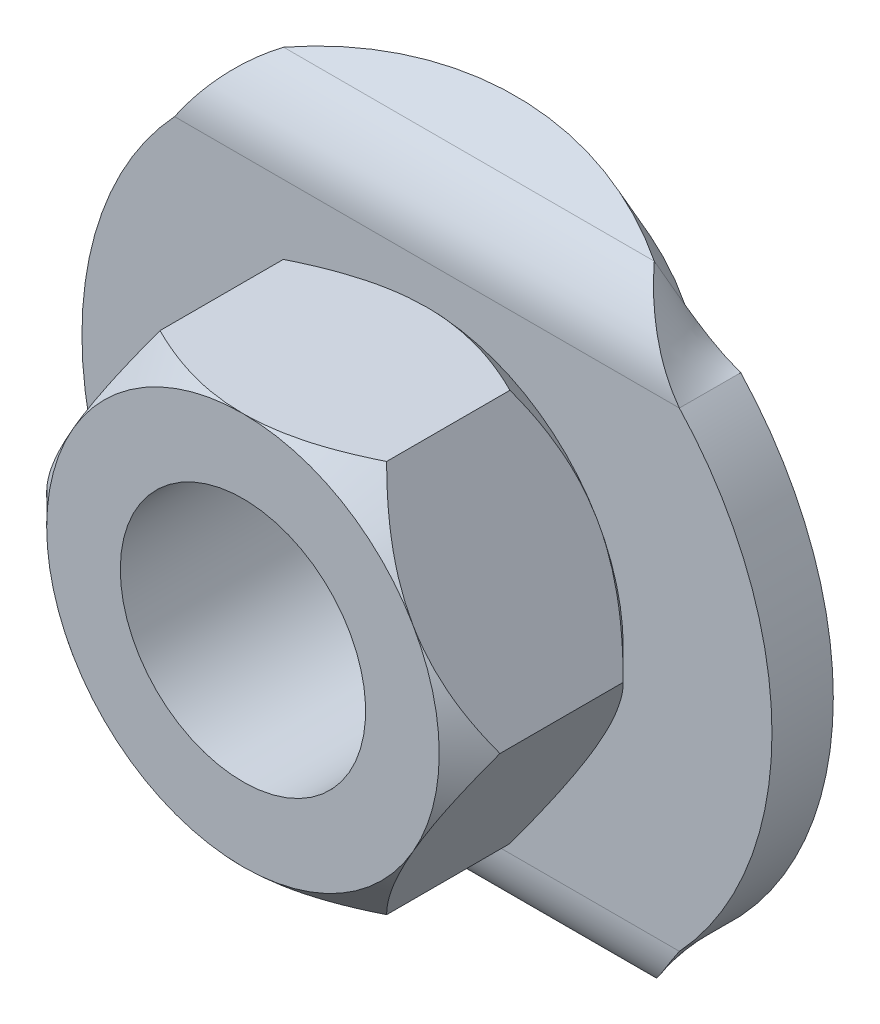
ISO-10303-21;
HEADER;
FILE_DESCRIPTION(('STEP AP214'),'2;1');
FILE_NAME('part.step','',(''),(''),'','','');
FILE_SCHEMA(('AUTOMOTIVE_DESIGN { 1 0 10303 214 1 1 1 1 }'));
ENDSEC;
DATA;
#1=APPLICATION_CONTEXT('core data for automotive mechanical design processes');
#2=APPLICATION_PROTOCOL_DEFINITION('international standard','automotive_design',2000,#1);
#3=PRODUCT_CONTEXT('',#1,'mechanical');
#4=PRODUCT('Part','Part','',(#3));
#5=PRODUCT_RELATED_PRODUCT_CATEGORY('part','',(#4));
#6=PRODUCT_DEFINITION_FORMATION('','',#4);
#7=PRODUCT_DEFINITION_CONTEXT('part definition',#1,'design');
#8=PRODUCT_DEFINITION('design','',#6,#7);
#9=PRODUCT_DEFINITION_SHAPE('','',#8);
#10=(LENGTH_UNIT() NAMED_UNIT(*) SI_UNIT(.MILLI.,.METRE.));
#11=(NAMED_UNIT(*) PLANE_ANGLE_UNIT() SI_UNIT($,.RADIAN.));
#12=(NAMED_UNIT(*) SI_UNIT($,.STERADIAN.) SOLID_ANGLE_UNIT());
#13=UNCERTAINTY_MEASURE_WITH_UNIT(LENGTH_MEASURE(1.E-05),#10,'distance_accuracy_value','');
#14=(GEOMETRIC_REPRESENTATION_CONTEXT(3) GLOBAL_UNCERTAINTY_ASSIGNED_CONTEXT((#13)) GLOBAL_UNIT_ASSIGNED_CONTEXT((#10,
#11,#12)) REPRESENTATION_CONTEXT('',''));
#15=CARTESIAN_POINT('',(0.,0.,0.));
#16=DIRECTION('',(0.,0.,1.));
#17=DIRECTION('',(1.,0.,0.));
#18=AXIS2_PLACEMENT_3D('',#15,#16,#17);
#19=CARTESIAN_POINT('',(0.,0.,0.));
#20=DIRECTION('',(0.,0.,1.));
#21=DIRECTION('',(-1.,0.,0.));
#22=AXIS2_PLACEMENT_3D('',#19,#20,#21);
#23=CYLINDRICAL_SURFACE('',#22,4.);
#24=CARTESIAN_POINT('',(0.,0.,0.));
#25=DIRECTION('',(0.,0.,-1.));
#26=DIRECTION('',(1.,0.,0.));
#27=AXIS2_PLACEMENT_3D('',#24,#25,#26);
#28=CIRCLE('',#27,4.);
#29=CARTESIAN_POINT('',(4.00000000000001,0.,0.));
#30=VERTEX_POINT('',#29);
#31=EDGE_CURVE('E1500',#30,#30,#28,.T.);
#32=ORIENTED_EDGE('',*,*,#31,.T.);
#33=EDGE_LOOP('',(#32));
#34=FACE_BOUND('',#33,.T.);
#35=CARTESIAN_POINT('',(0.,0.,8.));
#36=DIRECTION('',(0.,0.,1.));
#37=DIRECTION('',(0.866025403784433,-0.500000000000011,0.));
#38=AXIS2_PLACEMENT_3D('',#35,#36,#37);
#39=CIRCLE('',#38,4.);
#40=CARTESIAN_POINT('',(3.46410161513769,-2.00000000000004,8.));
#41=VERTEX_POINT('',#40);
#42=EDGE_CURVE('E531',#41,#41,#39,.T.);
#43=ORIENTED_EDGE('',*,*,#42,.T.);
#44=EDGE_LOOP('',(#43));
#45=FACE_BOUND('',#44,.T.);
#46=ADVANCED_FACE('F14',(#34,#45),#23,.F.);
#47=CARTESIAN_POINT('',(0.,0.,0.));
#48=DIRECTION('',(0.,0.,1.));
#49=DIRECTION('',(-1.,0.,0.));
#50=AXIS2_PLACEMENT_3D('',#47,#48,#49);
#51=CYLINDRICAL_SURFACE('',#50,11.25);
#52=CARTESIAN_POINT('',(0.,0.,0.));
#53=DIRECTION('',(0.,0.,-1.));
#54=DIRECTION('',(1.,0.,0.));
#55=AXIS2_PLACEMENT_3D('',#52,#53,#54);
#56=CIRCLE('',#55,11.25);
#57=CARTESIAN_POINT('',(-8.23002085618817,-7.67002325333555,5.36900385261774E-09));
#58=VERTEX_POINT('',#57);
#59=CARTESIAN_POINT('',(-8.23002085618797,7.67002325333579,5.36899691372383E-09));
#60=VERTEX_POINT('',#59);
#61=EDGE_CURVE('E1154',#58,#60,#56,.T.);
#62=ORIENTED_EDGE('',*,*,#61,.F.);
#63=CARTESIAN_POINT('',(-8.23002085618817,-7.67002325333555,5.36900385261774E-09));
#64=CARTESIAN_POINT('',(-8.23002085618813,-7.67002325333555,0.666666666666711));
#65=CARTESIAN_POINT('',(-8.2300208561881,-7.67002325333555,1.33333333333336));
#66=CARTESIAN_POINT('',(-8.23002085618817,-7.67002325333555,2.00000000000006));
#67=(BOUNDED_CURVE() B_SPLINE_CURVE(3,(#63,#64,#65,#66),.UNSPECIFIED.,.F.,
.F.) B_SPLINE_CURVE_WITH_KNOTS((4,4),(0.,1.),
.UNSPECIFIED.) CURVE() GEOMETRIC_REPRESENTATION_ITEM() RATIONAL_B_SPLINE_CURVE((1.,1.,1.,1.)) REPRESENTATION_ITEM(''));
#68=CARTESIAN_POINT('',(-8.23002085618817,-7.67002325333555,2.00000000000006));
#69=VERTEX_POINT('',#68);
#70=EDGE_CURVE('E1153',#58,#69,#67,.T.);
#71=ORIENTED_EDGE('',*,*,#70,.T.);
#72=CARTESIAN_POINT('',(0.,0.,2.00000000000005));
#73=DIRECTION('',(0.,0.,-1.));
#74=DIRECTION('',(1.,0.,0.));
#75=AXIS2_PLACEMENT_3D('',#72,#73,#74);
#76=CIRCLE('',#75,11.25);
#77=CARTESIAN_POINT('',(-8.23002085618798,7.67002325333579,2.00000000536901));
#78=VERTEX_POINT('',#77);
#79=EDGE_CURVE('E1393',#69,#78,#76,.T.);
#80=ORIENTED_EDGE('',*,*,#79,.T.);
#81=CARTESIAN_POINT('',(-8.23002085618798,7.67002325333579,2.00000000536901));
#82=CARTESIAN_POINT('',(-8.2300208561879,7.6700232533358,1.33333333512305));
#83=CARTESIAN_POINT('',(-8.23002085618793,7.6700232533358,0.666666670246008));
#84=CARTESIAN_POINT('',(-8.23002085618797,7.67002325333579,5.36899691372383E-09));
#85=(BOUNDED_CURVE() B_SPLINE_CURVE(3,(#81,#82,#83,#84),.UNSPECIFIED.,.F.,
.F.) B_SPLINE_CURVE_WITH_KNOTS((4,4),(0.,1.),
.UNSPECIFIED.) CURVE() GEOMETRIC_REPRESENTATION_ITEM() RATIONAL_B_SPLINE_CURVE((1.,1.,1.,1.)) REPRESENTATION_ITEM(''));
#86=EDGE_CURVE('E1300',#78,#60,#85,.T.);
#87=ORIENTED_EDGE('',*,*,#86,.T.);
#88=EDGE_LOOP('',(#62,#71,#80,#87));
#89=FACE_BOUND('',#88,.T.);
#90=ADVANCED_FACE('F1678',(#89),#51,.T.);
#91=CARTESIAN_POINT('',(0.,0.,2.00000000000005));
#92=DIRECTION('',(0.,0.,-1.));
#93=DIRECTION('',(1.,0.,0.));
#94=AXIS2_PLACEMENT_3D('',#91,#92,#93);
#95=PLANE('',#94);
#96=CARTESIAN_POINT('',(0.,0.,2.00000000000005));
#97=DIRECTION('',(0.,0.,-1.));
#98=DIRECTION('',(-1.,0.,0.));
#99=AXIS2_PLACEMENT_3D('',#96,#97,#98);
#100=CIRCLE('',#99,6.4);
#101=CARTESIAN_POINT('',(1.04083408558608E-13,6.4,2.00000000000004));
#102=VERTEX_POINT('',#101);
#103=CARTESIAN_POINT('',(5.54256258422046,3.19999999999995,2.00000000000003));
#104=VERTEX_POINT('',#103);
#105=EDGE_CURVE('E27',#102,#104,#100,.T.);
#106=ORIENTED_EDGE('',*,*,#105,.T.);
#107=CARTESIAN_POINT('',(0.,0.,2.00000000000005));
#108=DIRECTION('',(0.,0.,-1.));
#109=DIRECTION('',(-1.,0.,0.));
#110=AXIS2_PLACEMENT_3D('',#107,#108,#109);
#111=CIRCLE('',#110,6.4);
#112=CARTESIAN_POINT('',(5.54256258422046,-3.2000000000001,2.00000000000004));
#113=VERTEX_POINT('',#112);
#114=EDGE_CURVE('E9',#104,#113,#111,.T.);
#115=ORIENTED_EDGE('',*,*,#114,.T.);
#116=CARTESIAN_POINT('',(0.,0.,2.00000000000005));
#117=DIRECTION('',(0.,0.,-1.));
#118=DIRECTION('',(-1.,0.,0.));
#119=AXIS2_PLACEMENT_3D('',#116,#117,#118);
#120=CIRCLE('',#119,6.4);
#121=CARTESIAN_POINT('',(0.,-6.4,2.00000000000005));
#122=VERTEX_POINT('',#121);
#123=EDGE_CURVE('E891',#113,#122,#120,.T.);
#124=ORIENTED_EDGE('',*,*,#123,.T.);
#125=CARTESIAN_POINT('',(0.,0.,2.00000000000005));
#126=DIRECTION('',(0.,0.,-1.));
#127=DIRECTION('',(-1.,0.,0.));
#128=AXIS2_PLACEMENT_3D('',#125,#126,#127);
#129=CIRCLE('',#128,6.4);
#130=CARTESIAN_POINT('',(-5.54256258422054,-3.19999999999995,2.00000000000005));
#131=VERTEX_POINT('',#130);
#132=EDGE_CURVE('E1050',#122,#131,#129,.T.);
#133=ORIENTED_EDGE('',*,*,#132,.T.);
#134=CARTESIAN_POINT('',(0.,0.,2.00000000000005));
#135=DIRECTION('',(0.,0.,-1.));
#136=DIRECTION('',(-1.,0.,0.));
#137=AXIS2_PLACEMENT_3D('',#134,#135,#136);
#138=CIRCLE('',#137,6.4);
#139=CARTESIAN_POINT('',(-5.54256258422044,3.20000000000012,2.00000000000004));
#140=VERTEX_POINT('',#139);
#141=EDGE_CURVE('E1926',#131,#140,#138,.T.);
#142=ORIENTED_EDGE('',*,*,#141,.T.);
#143=CARTESIAN_POINT('',(0.,0.,2.00000000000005));
#144=DIRECTION('',(0.,0.,-1.));
#145=DIRECTION('',(-1.,0.,0.));
#146=AXIS2_PLACEMENT_3D('',#143,#144,#145);
#147=CIRCLE('',#146,6.4);
#148=EDGE_CURVE('E1922',#140,#102,#147,.T.);
#149=ORIENTED_EDGE('',*,*,#148,.T.);
#150=EDGE_LOOP('',(#106,#115,#124,#133,#142,#149));
#151=FACE_BOUND('',#150,.T.);
#152=CARTESIAN_POINT('',(0.,0.,2.00000000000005));
#153=DIRECTION('',(0.,0.,-1.));
#154=DIRECTION('',(1.,0.,0.));
#155=AXIS2_PLACEMENT_3D('',#152,#153,#154);
#156=CIRCLE('',#155,11.25);
#157=CARTESIAN_POINT('',(8.23002085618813,7.67002325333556,2.00000000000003));
#158=VERTEX_POINT('',#157);
#159=CARTESIAN_POINT('',(8.23002085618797,-7.6700232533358,2.00000000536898));
#160=VERTEX_POINT('',#159);
#161=EDGE_CURVE('E1159',#158,#160,#156,.T.);
#162=ORIENTED_EDGE('',*,*,#161,.F.);
#163=DIRECTION('',(-1.,0.,0.));
#164=VECTOR('',#163,1.);
#165=CARTESIAN_POINT('',(1.04083408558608E-13,7.67002325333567,2.00000000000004));
#166=LINE('',#165,#164);
#167=EDGE_CURVE('E1292',#158,#78,#166,.T.);
#168=ORIENTED_EDGE('',*,*,#167,.T.);
#169=ORIENTED_EDGE('',*,*,#79,.F.);
#170=DIRECTION('',(1.,0.,0.));
#171=VECTOR('',#170,1.);
#172=CARTESIAN_POINT('',(0.,-7.6700232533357,2.00000000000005));
#173=LINE('',#172,#171);
#174=EDGE_CURVE('E1286',#69,#160,#173,.T.);
#175=ORIENTED_EDGE('',*,*,#174,.T.);
#176=EDGE_LOOP('',(#162,#168,#169,#175));
#177=FACE_BOUND('',#176,.T.);
#178=ADVANCED_FACE('F1626',(#151,#177),#95,.F.);
#179=CARTESIAN_POINT('',(0.,0.,0.));
#180=DIRECTION('',(0.,0.,1.));
#181=DIRECTION('',(-1.,0.,0.));
#182=AXIS2_PLACEMENT_3D('',#179,#180,#181);
#183=CYLINDRICAL_SURFACE('',#182,11.25);
#184=CARTESIAN_POINT('',(0.,0.,0.));
#185=DIRECTION('',(0.,0.,-1.));
#186=DIRECTION('',(1.,0.,0.));
#187=AXIS2_PLACEMENT_3D('',#184,#185,#186);
#188=CIRCLE('',#187,11.25);
#189=CARTESIAN_POINT('',(8.23002085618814,7.67002325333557,5.36897609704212E-09));
#190=VERTEX_POINT('',#189);
#191=CARTESIAN_POINT('',(8.23002085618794,-7.6700232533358,5.36898303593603E-09));
#192=VERTEX_POINT('',#191);
#193=EDGE_CURVE('E1144',#190,#192,#188,.T.);
#194=ORIENTED_EDGE('',*,*,#193,.F.);
#195=CARTESIAN_POINT('',(8.23002085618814,7.67002325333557,5.36897609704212E-09));
#196=CARTESIAN_POINT('',(8.23002085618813,7.67002325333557,0.666666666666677));
#197=CARTESIAN_POINT('',(8.23002085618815,7.67002325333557,1.33333333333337));
#198=CARTESIAN_POINT('',(8.23002085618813,7.67002325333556,2.00000000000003));
#199=(BOUNDED_CURVE() B_SPLINE_CURVE(3,(#195,#196,#197,#198),.UNSPECIFIED.,.F.,
.F.) B_SPLINE_CURVE_WITH_KNOTS((4,4),(0.,1.),
.UNSPECIFIED.) CURVE() GEOMETRIC_REPRESENTATION_ITEM() RATIONAL_B_SPLINE_CURVE((1.,1.,1.,1.)) REPRESENTATION_ITEM(''));
#200=EDGE_CURVE('E1293',#190,#158,#199,.T.);
#201=ORIENTED_EDGE('',*,*,#200,.T.);
#202=ORIENTED_EDGE('',*,*,#161,.T.);
#203=CARTESIAN_POINT('',(8.23002085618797,-7.6700232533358,2.00000000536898));
#204=CARTESIAN_POINT('',(8.23002085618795,-7.6700232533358,1.33333333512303));
#205=CARTESIAN_POINT('',(8.23002085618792,-7.6700232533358,0.666666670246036));
#206=CARTESIAN_POINT('',(8.23002085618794,-7.6700232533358,5.36898303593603E-09));
#207=(BOUNDED_CURVE() B_SPLINE_CURVE(3,(#203,#204,#205,#206),.UNSPECIFIED.,.F.,
.F.) B_SPLINE_CURVE_WITH_KNOTS((4,4),(0.,1.),
.UNSPECIFIED.) CURVE() GEOMETRIC_REPRESENTATION_ITEM() RATIONAL_B_SPLINE_CURVE((1.,1.,1.,1.)) REPRESENTATION_ITEM(''));
#208=EDGE_CURVE('E1157',#160,#192,#207,.T.);
#209=ORIENTED_EDGE('',*,*,#208,.T.);
#210=EDGE_LOOP('',(#194,#201,#202,#209));
#211=FACE_BOUND('',#210,.T.);
#212=ADVANCED_FACE('F1158',(#211),#183,.T.);
#213=CARTESIAN_POINT('',(0.,0.,0.));
#214=DIRECTION('',(0.,0.,-1.));
#215=DIRECTION('',(1.,0.,0.));
#216=AXIS2_PLACEMENT_3D('',#213,#214,#215);
#217=PLANE('',#216);
#218=DIRECTION('',(-1.,0.,0.));
#219=VECTOR('',#218,1.);
#220=CARTESIAN_POINT('',(1.17961196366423E-13,7.67002325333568,0.));
#221=LINE('',#220,#219);
#222=EDGE_CURVE('E1148',#190,#60,#221,.T.);
#223=ORIENTED_EDGE('',*,*,#222,.F.);
#224=ORIENTED_EDGE('',*,*,#193,.T.);
#225=DIRECTION('',(1.,0.,0.));
#226=VECTOR('',#225,1.);
#227=CARTESIAN_POINT('',(0.,-7.6700232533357,0.));
#228=LINE('',#227,#226);
#229=EDGE_CURVE('E1127',#58,#192,#228,.T.);
#230=ORIENTED_EDGE('',*,*,#229,.F.);
#231=ORIENTED_EDGE('',*,*,#61,.T.);
#232=EDGE_LOOP('',(#223,#224,#230,#231));
#233=FACE_BOUND('',#232,.T.);
#234=ORIENTED_EDGE('',*,*,#31,.F.);
#235=EDGE_LOOP('',(#234));
#236=FACE_BOUND('',#235,.T.);
#237=ADVANCED_FACE('F1146',(#233,#236),#217,.T.);
#238=CARTESIAN_POINT('',(-6.04394125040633,-10.0399883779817,0.631700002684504));
#239=CARTESIAN_POINT('',(-6.40841819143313,-9.80108954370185,1.04548492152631));
#240=CARTESIAN_POINT('',(-6.77263445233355,-9.4519602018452,1.39455172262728));
#241=CARTESIAN_POINT('',(-7.50132765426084,-8.62468631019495,1.87217852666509));
#242=CARTESIAN_POINT('',(-7.86554391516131,-8.1478209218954,2.00000000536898));
#243=CARTESIAN_POINT('',(-8.23002085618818,-7.67002325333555,2.00000000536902));
#244=CARTESIAN_POINT('',(-6.04394125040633,-8.30793757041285,-0.368299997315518));
#245=CARTESIAN_POINT('',(-6.40831068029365,-8.2436530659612,-0.256955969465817));
#246=CARTESIAN_POINT('',(-6.77263445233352,-8.14966030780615,-0.162966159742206));
#247=CARTESIAN_POINT('',(-7.50132765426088,-7.92698620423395,-0.0344052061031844));
#248=CARTESIAN_POINT('',(-7.8656514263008,-7.79859226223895,5.36904548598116E-09));
#249=CARTESIAN_POINT('',(-8.23002085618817,-7.67002325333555,5.36900385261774E-09));
#250=(BOUNDED_SURFACE() B_SPLINE_SURFACE(1,3,((#238,#239,#240,#241,#242,#243),(#244,#245,#246,
#247,#248,#249)),.UNSPECIFIED.,.F.,.F.,.F.) B_SPLINE_SURFACE_WITH_KNOTS((2,2),(4,2,4),(0.,1.),
(0.,0.5,1.),.UNSPECIFIED.) GEOMETRIC_REPRESENTATION_ITEM() RATIONAL_B_SPLINE_SURFACE(((1.,1.,1.,
1.,1.,1.),(1.,1.,1.,1.,1.,1.))) REPRESENTATION_ITEM('') SURFACE());
#251=CARTESIAN_POINT('',(-6.04394125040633,-8.30793757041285,-0.368299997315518));
#252=CARTESIAN_POINT('',(-6.04394125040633,-10.0399883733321,0.631700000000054));
#253=(BOUNDED_CURVE() B_SPLINE_CURVE(1,(#251,#252),.UNSPECIFIED.,.F.,
.F.) B_SPLINE_CURVE_WITH_KNOTS((2,2),(0.,1.),
.UNSPECIFIED.) CURVE() GEOMETRIC_REPRESENTATION_ITEM() RATIONAL_B_SPLINE_CURVE((1.,1.)) REPRESENTATION_ITEM(''));
#254=CARTESIAN_POINT('',(-6.04394125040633,-8.30793757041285,-0.368299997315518));
#255=VERTEX_POINT('',#254);
#256=CARTESIAN_POINT('',(-6.04394125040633,-10.0399883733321,0.631700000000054));
#257=VERTEX_POINT('',#256);
#258=EDGE_CURVE('E1260',#255,#257,#253,.T.);
#259=CARTESIAN_POINT('',(-6.04394125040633,-10.0399883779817,0.631700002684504));
#260=CARTESIAN_POINT('',(-6.40841819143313,-9.80108954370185,1.04548492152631));
#261=CARTESIAN_POINT('',(-6.77263445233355,-9.4519602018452,1.39455172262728));
#262=CARTESIAN_POINT('',(-7.50132765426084,-8.62468631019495,1.87217852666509));
#263=CARTESIAN_POINT('',(-7.86554391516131,-8.1478209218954,2.00000000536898));
#264=CARTESIAN_POINT('',(-8.23002085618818,-7.67002325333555,2.00000000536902));
#265=(BOUNDED_CURVE() B_SPLINE_CURVE(3,(#259,#260,#261,#262,#263,#264),.UNSPECIFIED.,.F.,
.F.) B_SPLINE_CURVE_WITH_KNOTS((4,2,4),(0.,0.5,1.),
.UNSPECIFIED.) CURVE() GEOMETRIC_REPRESENTATION_ITEM() RATIONAL_B_SPLINE_CURVE((1.,1.,1.,1.,1.,1.)) REPRESENTATION_ITEM(''));
#266=EDGE_CURVE('E1141',#257,#69,#265,.T.);
#267=CARTESIAN_POINT('',(-8.23002085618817,-7.67002325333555,5.36900385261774E-09));
#268=CARTESIAN_POINT('',(-7.8656514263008,-7.79859226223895,5.36904548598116E-09));
#269=CARTESIAN_POINT('',(-7.50132765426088,-7.92698620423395,-0.0344052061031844));
#270=CARTESIAN_POINT('',(-6.77263445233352,-8.14966030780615,-0.162966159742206));
#271=CARTESIAN_POINT('',(-6.40831068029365,-8.2436530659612,-0.256955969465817));
#272=CARTESIAN_POINT('',(-6.04394125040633,-8.30793757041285,-0.368299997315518));
#273=(BOUNDED_CURVE() B_SPLINE_CURVE(3,(#267,#268,#269,#270,#271,#272),.UNSPECIFIED.,.F.,
.F.) B_SPLINE_CURVE_WITH_KNOTS((4,2,4),(0.,0.5,1.),
.UNSPECIFIED.) CURVE() GEOMETRIC_REPRESENTATION_ITEM() RATIONAL_B_SPLINE_CURVE((1.,1.,1.,1.,1.,1.)) REPRESENTATION_ITEM(''));
#274=EDGE_CURVE('E1135',#255,#58,#273,.F.);
#275=ORIENTED_EDGE('',*,*,#258,.T.);
#276=ORIENTED_EDGE('',*,*,#266,.T.);
#277=ORIENTED_EDGE('',*,*,#70,.F.);
#278=ORIENTED_EDGE('',*,*,#274,.F.);
#279=EDGE_LOOP('',(#275,#276,#277,#278));
#280=FACE_BOUND('',#279,.T.);
#281=ADVANCED_FACE('F1235',(#280),#250,.F.);
#282=CARTESIAN_POINT('',(16.6805319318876,-7.6700232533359,-0.736599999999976));
#283=DIRECTION('',(-1.,0.,0.));
#284=DIRECTION('',(0.,0.,-1.));
#285=AXIS2_PLACEMENT_3D('',#282,#283,#284);
#286=CYLINDRICAL_SURFACE('',#285,0.736600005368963);
#287=ORIENTED_EDGE('',*,*,#229,.T.);
#288=CARTESIAN_POINT('',(6.04394125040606,-8.30793757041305,-0.368299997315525));
#289=CARTESIAN_POINT('',(6.19216154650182,-8.2867142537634,-0.331540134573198));
#290=CARTESIAN_POINT('',(6.3488887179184,-8.25956384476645,-0.291774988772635));
#291=CARTESIAN_POINT('',(6.67929295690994,-8.18929083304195,-0.211444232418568));
#292=CARTESIAN_POINT('',(6.8529806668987,-8.14610657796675,-0.170864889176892));
#293=CARTESIAN_POINT('',(7.21732726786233,-8.0409170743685,-0.0969521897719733));
#294=CARTESIAN_POINT('',(7.40798615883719,-7.9788314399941,-0.063642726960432));
#295=CARTESIAN_POINT('',(7.80627512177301,-7.8364807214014,-0.0151251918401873));
#296=CARTESIAN_POINT('',(8.01386643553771,-7.7561499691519,5.36898997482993E-09));
#297=CARTESIAN_POINT('',(8.23002085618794,-7.6700232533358,5.36898303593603E-09));
#298=(BOUNDED_CURVE() B_SPLINE_CURVE(3,(#288,#289,#290,#291,#292,#293,#294,#295,#296,#297),
.UNSPECIFIED.,.F.,.F.) B_SPLINE_CURVE_WITH_KNOTS((4,2,2,2,4),(0.,0.25,0.5,0.75,1.),
.UNSPECIFIED.) CURVE() GEOMETRIC_REPRESENTATION_ITEM() RATIONAL_B_SPLINE_CURVE((1.,1.,1.,1.,1.,
1.,1.,1.,1.,1.)) REPRESENTATION_ITEM(''));
#299=CARTESIAN_POINT('',(6.04394125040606,-8.3079375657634,-0.368299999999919));
#300=VERTEX_POINT('',#299);
#301=EDGE_CURVE('E1131',#192,#300,#298,.F.);
#302=ORIENTED_EDGE('',*,*,#301,.T.);
#303=DIRECTION('',(1.,0.,0.));
#304=VECTOR('',#303,1.);
#305=CARTESIAN_POINT('',(-1.2490009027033E-13,-8.3079375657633,-0.368299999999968));
#306=LINE('',#305,#304);
#307=EDGE_CURVE('E1275',#255,#300,#306,.T.);
#308=ORIENTED_EDGE('',*,*,#307,.F.);
#309=ORIENTED_EDGE('',*,*,#274,.T.);
#310=EDGE_LOOP('',(#287,#302,#308,#309));
#311=FACE_BOUND('',#310,.T.);
#312=ADVANCED_FACE('F1129',(#311),#286,.F.);
#313=CARTESIAN_POINT('',(8.23002085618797,-7.6700232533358,2.00000000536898));
#314=CARTESIAN_POINT('',(8.01371095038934,-7.99022948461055,2.00000000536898));
#315=CARTESIAN_POINT('',(7.80627512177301,-8.28844234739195,1.94380720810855));
#316=CARTESIAN_POINT('',(7.40798615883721,-8.81730058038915,1.76355593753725));
#317=CARTESIAN_POINT('',(7.21732726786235,-9.04795975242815,1.63980535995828));
#318=CARTESIAN_POINT('',(6.85298066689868,-9.43875746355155,1.3652065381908));
#319=CARTESIAN_POINT('',(6.67929295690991,-9.5991946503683,1.21444706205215));
#320=CARTESIAN_POINT('',(6.34888871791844,-9.8602713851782,0.9160040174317));
#321=CARTESIAN_POINT('',(6.19209763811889,-9.9611739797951,0.76821054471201));
#322=CARTESIAN_POINT('',(6.04394125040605,-10.0399883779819,0.63170000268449));
#323=CARTESIAN_POINT('',(8.23002085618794,-7.6700232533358,5.36898303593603E-09));
#324=CARTESIAN_POINT('',(8.01386643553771,-7.7561499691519,5.36898997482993E-09));
#325=CARTESIAN_POINT('',(7.80627512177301,-7.8364807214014,-0.0151251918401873));
#326=CARTESIAN_POINT('',(7.40798615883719,-7.9788314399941,-0.063642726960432));
#327=CARTESIAN_POINT('',(7.21732726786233,-8.0409170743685,-0.0969521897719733));
#328=CARTESIAN_POINT('',(6.8529806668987,-8.14610657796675,-0.170864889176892));
#329=CARTESIAN_POINT('',(6.67929295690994,-8.18929083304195,-0.211444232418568));
#330=CARTESIAN_POINT('',(6.3488887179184,-8.25956384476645,-0.291774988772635));
#331=CARTESIAN_POINT('',(6.19216154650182,-8.2867142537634,-0.331540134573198));
#332=CARTESIAN_POINT('',(6.04394125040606,-8.30793757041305,-0.368299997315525));
#333=(BOUNDED_SURFACE() B_SPLINE_SURFACE(1,3,((#313,#314,#315,#316,#317,#318,#319,#320,#321,
#322),(#323,#324,#325,#326,#327,#328,#329,#330,#331,#332)),.UNSPECIFIED.,.F.,.F.,
.F.) B_SPLINE_SURFACE_WITH_KNOTS((2,2),(4,2,2,2,4),(0.,1.),(0.,0.25,0.5,0.75,1.),
.UNSPECIFIED.) GEOMETRIC_REPRESENTATION_ITEM() RATIONAL_B_SPLINE_SURFACE(((1.,1.,1.,1.,1.,1.,1.,
1.,1.,1.),(1.,1.,1.,1.,1.,1.,1.,1.,1.,1.))) REPRESENTATION_ITEM('') SURFACE());
#334=CARTESIAN_POINT('',(8.23002085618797,-7.6700232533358,2.00000000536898));
#335=CARTESIAN_POINT('',(8.01371095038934,-7.99022948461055,2.00000000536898));
#336=CARTESIAN_POINT('',(7.80627512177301,-8.28844234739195,1.94380720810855));
#337=CARTESIAN_POINT('',(7.40798615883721,-8.81730058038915,1.76355593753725));
#338=CARTESIAN_POINT('',(7.21732726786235,-9.04795975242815,1.63980535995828));
#339=CARTESIAN_POINT('',(6.85298066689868,-9.43875746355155,1.3652065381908));
#340=CARTESIAN_POINT('',(6.67929295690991,-9.5991946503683,1.21444706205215));
#341=CARTESIAN_POINT('',(6.34888871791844,-9.8602713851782,0.9160040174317));
#342=CARTESIAN_POINT('',(6.19209763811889,-9.9611739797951,0.76821054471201));
#343=CARTESIAN_POINT('',(6.04394125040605,-10.0399883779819,0.63170000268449));
#344=(BOUNDED_CURVE() B_SPLINE_CURVE(3,(#334,#335,#336,#337,#338,#339,#340,#341,#342,#343),
.UNSPECIFIED.,.F.,.F.) B_SPLINE_CURVE_WITH_KNOTS((4,2,2,2,4),(0.,0.25,0.5,0.75,1.),
.UNSPECIFIED.) CURVE() GEOMETRIC_REPRESENTATION_ITEM() RATIONAL_B_SPLINE_CURVE((1.,1.,1.,1.,1.,
1.,1.,1.,1.,1.)) REPRESENTATION_ITEM(''));
#345=CARTESIAN_POINT('',(6.04394125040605,-10.0399883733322,0.631700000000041));
#346=VERTEX_POINT('',#345);
#347=EDGE_CURVE('E1219',#160,#346,#344,.T.);
#348=CARTESIAN_POINT('',(6.04394125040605,-10.0399883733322,0.631700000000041));
#349=CARTESIAN_POINT('',(6.04394125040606,-8.3079375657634,-0.368299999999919));
#350=(BOUNDED_CURVE() B_SPLINE_CURVE(1,(#348,#349),.UNSPECIFIED.,.F.,
.F.) B_SPLINE_CURVE_WITH_KNOTS((2,2),(0.,1.),
.UNSPECIFIED.) CURVE() GEOMETRIC_REPRESENTATION_ITEM() RATIONAL_B_SPLINE_CURVE((1.,1.)) REPRESENTATION_ITEM(''));
#351=EDGE_CURVE('E1169',#346,#300,#350,.T.);
#352=ORIENTED_EDGE('',*,*,#347,.T.);
#353=ORIENTED_EDGE('',*,*,#351,.T.);
#354=ORIENTED_EDGE('',*,*,#301,.F.);
#355=ORIENTED_EDGE('',*,*,#208,.F.);
#356=EDGE_LOOP('',(#352,#353,#354,#355));
#357=FACE_BOUND('',#356,.T.);
#358=ADVANCED_FACE('F1167',(#357),#333,.F.);
#359=CARTESIAN_POINT('',(16.6805319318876,-7.6700232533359,-0.736599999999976));
#360=DIRECTION('',(-1.,0.,0.));
#361=DIRECTION('',(0.,0.,-1.));
#362=AXIS2_PLACEMENT_3D('',#359,#360,#361);
#363=CYLINDRICAL_SURFACE('',#362,2.73660000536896);
#364=ORIENTED_EDGE('',*,*,#174,.F.);
#365=ORIENTED_EDGE('',*,*,#266,.F.);
#366=DIRECTION('',(1.,0.,0.));
#367=VECTOR('',#366,1.);
#368=CARTESIAN_POINT('',(-1.38777878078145E-13,-10.0399883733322,0.6317));
#369=LINE('',#368,#367);
#370=EDGE_CURVE('E1249',#257,#346,#369,.T.);
#371=ORIENTED_EDGE('',*,*,#370,.T.);
#372=ORIENTED_EDGE('',*,*,#347,.F.);
#373=EDGE_LOOP('',(#364,#365,#371,#372));
#374=FACE_BOUND('',#373,.T.);
#375=ADVANCED_FACE('F1191',(#374),#363,.T.);
#376=CARTESIAN_POINT('',(0.,-3.56364430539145,7.84905697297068));
#377=DIRECTION('',(0.,0.86602540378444,-0.5));
#378=DIRECTION('',(-1.,0.,0.));
#379=AXIS2_PLACEMENT_3D('',#376,#377,#378);
#380=PLANE('',#379);
#381=CARTESIAN_POINT('',(0.,-3.56364430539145,7.84905697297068));
#382=DIRECTION('',(0.,0.86602540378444,-0.5));
#383=DIRECTION('',(1.,0.,0.));
#384=AXIS2_PLACEMENT_3D('',#381,#382,#383);
#385=CIRCLE('',#384,11.25);
#386=EDGE_CURVE('E1257',#300,#255,#385,.T.);
#387=ORIENTED_EDGE('',*,*,#386,.T.);
#388=ORIENTED_EDGE('',*,*,#307,.T.);
#389=EDGE_LOOP('',(#387,#388));
#390=FACE_BOUND('',#389,.T.);
#391=ADVANCED_FACE('F1234',(#390),#380,.T.);
#392=CARTESIAN_POINT('',(0.,-3.56364430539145,7.84905697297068));
#393=DIRECTION('',(0.,-0.86602540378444,0.5));
#394=DIRECTION('',(-1.,0.,0.));
#395=AXIS2_PLACEMENT_3D('',#392,#393,#394);
#396=CYLINDRICAL_SURFACE('',#395,11.25);
#397=ORIENTED_EDGE('',*,*,#258,.F.);
#398=ORIENTED_EDGE('',*,*,#386,.F.);
#399=ORIENTED_EDGE('',*,*,#351,.F.);
#400=CARTESIAN_POINT('',(0.,-5.29569511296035,8.84905697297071));
#401=DIRECTION('',(0.,0.86602540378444,-0.5));
#402=DIRECTION('',(1.,0.,0.));
#403=AXIS2_PLACEMENT_3D('',#400,#401,#402);
#404=CIRCLE('',#403,11.25);
#405=EDGE_CURVE('E1268',#346,#257,#404,.T.);
#406=ORIENTED_EDGE('',*,*,#405,.T.);
#407=EDGE_LOOP('',(#397,#398,#399,#406));
#408=FACE_BOUND('',#407,.T.);
#409=ADVANCED_FACE('F1606',(#408),#396,.T.);
#410=CARTESIAN_POINT('',(0.,-5.29569511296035,8.84905697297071));
#411=DIRECTION('',(0.,0.86602540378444,-0.5));
#412=DIRECTION('',(-1.,0.,0.));
#413=AXIS2_PLACEMENT_3D('',#410,#411,#412);
#414=PLANE('',#413);
#415=ORIENTED_EDGE('',*,*,#370,.F.);
#416=ORIENTED_EDGE('',*,*,#405,.F.);
#417=EDGE_LOOP('',(#415,#416));
#418=FACE_BOUND('',#417,.T.);
#419=ADVANCED_FACE('F1614',(#418),#414,.F.);
#420=CARTESIAN_POINT('',(6.04394125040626,10.0399883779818,0.631700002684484));
#421=CARTESIAN_POINT('',(6.40841819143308,9.80108954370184,1.04548492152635));
#422=CARTESIAN_POINT('',(6.77263445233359,9.45196020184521,1.39455172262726));
#423=CARTESIAN_POINT('',(7.50132765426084,8.62468631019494,1.87217852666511));
#424=CARTESIAN_POINT('',(7.8655439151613,8.14782092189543,2.000000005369));
#425=CARTESIAN_POINT('',(8.23002085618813,7.67002325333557,2.00000000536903));
#426=CARTESIAN_POINT('',(6.04394125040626,8.30793757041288,-0.368299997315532));
#427=CARTESIAN_POINT('',(6.40831068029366,8.24365306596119,-0.256955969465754));
#428=CARTESIAN_POINT('',(6.77263445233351,8.14966030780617,-0.162966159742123));
#429=CARTESIAN_POINT('',(7.50132765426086,7.92698620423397,-0.0344052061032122));
#430=CARTESIAN_POINT('',(7.86565142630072,7.79859226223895,5.36904548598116E-09));
#431=CARTESIAN_POINT('',(8.23002085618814,7.67002325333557,5.36897609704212E-09));
#432=(BOUNDED_SURFACE() B_SPLINE_SURFACE(1,3,((#420,#421,#422,#423,#424,#425),(#426,#427,#428,
#429,#430,#431)),.UNSPECIFIED.,.F.,.F.,.F.) B_SPLINE_SURFACE_WITH_KNOTS((2,2),(4,2,4),(0.,1.),
(0.,0.5,1.),.UNSPECIFIED.) GEOMETRIC_REPRESENTATION_ITEM() RATIONAL_B_SPLINE_SURFACE(((1.,1.,1.,
1.,1.,1.),(1.,1.,1.,1.,1.,1.))) REPRESENTATION_ITEM('') SURFACE());
#433=CARTESIAN_POINT('',(6.04394125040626,8.30793757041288,-0.368299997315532));
#434=CARTESIAN_POINT('',(6.04394125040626,10.0399883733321,0.631700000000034));
#435=(BOUNDED_CURVE() B_SPLINE_CURVE(1,(#433,#434),.UNSPECIFIED.,.F.,
.F.) B_SPLINE_CURVE_WITH_KNOTS((2,2),(0.,1.),
.UNSPECIFIED.) CURVE() GEOMETRIC_REPRESENTATION_ITEM() RATIONAL_B_SPLINE_CURVE((1.,1.)) REPRESENTATION_ITEM(''));
#436=CARTESIAN_POINT('',(6.04394125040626,8.30793757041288,-0.368299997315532));
#437=VERTEX_POINT('',#436);
#438=CARTESIAN_POINT('',(6.04394125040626,10.0399883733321,0.631700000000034));
#439=VERTEX_POINT('',#438);
#440=EDGE_CURVE('E1276',#437,#439,#435,.T.);
#441=CARTESIAN_POINT('',(6.04394125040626,10.0399883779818,0.631700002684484));
#442=CARTESIAN_POINT('',(6.40841819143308,9.80108954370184,1.04548492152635));
#443=CARTESIAN_POINT('',(6.77263445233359,9.45196020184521,1.39455172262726));
#444=CARTESIAN_POINT('',(7.50132765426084,8.62468631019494,1.87217852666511));
#445=CARTESIAN_POINT('',(7.8655439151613,8.14782092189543,2.000000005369));
#446=CARTESIAN_POINT('',(8.23002085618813,7.67002325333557,2.00000000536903));
#447=(BOUNDED_CURVE() B_SPLINE_CURVE(3,(#441,#442,#443,#444,#445,#446),.UNSPECIFIED.,.F.,
.F.) B_SPLINE_CURVE_WITH_KNOTS((4,2,4),(0.,0.5,1.),
.UNSPECIFIED.) CURVE() GEOMETRIC_REPRESENTATION_ITEM() RATIONAL_B_SPLINE_CURVE((1.,1.,1.,1.,1.,1.)) REPRESENTATION_ITEM(''));
#448=EDGE_CURVE('E1426',#439,#158,#447,.T.);
#449=CARTESIAN_POINT('',(8.23002085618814,7.67002325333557,5.36897609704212E-09));
#450=CARTESIAN_POINT('',(7.86565142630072,7.79859226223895,5.36904548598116E-09));
#451=CARTESIAN_POINT('',(7.50132765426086,7.92698620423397,-0.0344052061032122));
#452=CARTESIAN_POINT('',(6.77263445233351,8.14966030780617,-0.162966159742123));
#453=CARTESIAN_POINT('',(6.40831068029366,8.24365306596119,-0.256955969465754));
#454=CARTESIAN_POINT('',(6.04394125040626,8.30793757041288,-0.368299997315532));
#455=(BOUNDED_CURVE() B_SPLINE_CURVE(3,(#449,#450,#451,#452,#453,#454),.UNSPECIFIED.,.F.,
.F.) B_SPLINE_CURVE_WITH_KNOTS((4,2,4),(0.,0.5,1.),
.UNSPECIFIED.) CURVE() GEOMETRIC_REPRESENTATION_ITEM() RATIONAL_B_SPLINE_CURVE((1.,1.,1.,1.,1.,1.)) REPRESENTATION_ITEM(''));
#456=EDGE_CURVE('E1362',#437,#190,#455,.F.);
#457=ORIENTED_EDGE('',*,*,#440,.T.);
#458=ORIENTED_EDGE('',*,*,#448,.T.);
#459=ORIENTED_EDGE('',*,*,#200,.F.);
#460=ORIENTED_EDGE('',*,*,#456,.F.);
#461=EDGE_LOOP('',(#457,#458,#459,#460));
#462=FACE_BOUND('',#461,.T.);
#463=ADVANCED_FACE('F1341',(#462),#432,.F.);
#464=CARTESIAN_POINT('',(-16.6805319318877,7.6700232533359,-0.736599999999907));
#465=DIRECTION('',(1.,0.,0.));
#466=DIRECTION('',(0.,0.,1.));
#467=AXIS2_PLACEMENT_3D('',#464,#465,#466);
#468=CYLINDRICAL_SURFACE('',#467,0.736600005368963);
#469=ORIENTED_EDGE('',*,*,#222,.T.);
#470=CARTESIAN_POINT('',(-6.04394125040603,8.30793757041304,-0.368299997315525));
#471=CARTESIAN_POINT('',(-6.19213645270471,8.28671784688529,-0.331546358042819));
#472=CARTESIAN_POINT('',(-6.34884480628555,8.25957124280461,-0.291785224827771));
#473=CARTESIAN_POINT('',(-6.67922395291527,8.18930472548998,-0.211458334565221));
#474=CARTESIAN_POINT('',(-6.8529053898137,8.14612313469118,-0.170878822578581));
#475=CARTESIAN_POINT('',(-7.21725199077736,8.04093579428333,-0.0969630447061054));
#476=CARTESIAN_POINT('',(-7.40791715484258,7.97884961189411,-0.0636506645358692));
#477=CARTESIAN_POINT('',(-7.80623121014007,7.83649315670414,-0.0151276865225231));
#478=CARTESIAN_POINT('',(-8.01384132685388,7.7561571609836,5.36904548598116E-09));
#479=CARTESIAN_POINT('',(-8.23002085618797,7.67002325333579,5.36899691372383E-09));
#480=(BOUNDED_CURVE() B_SPLINE_CURVE(3,(#470,#471,#472,#473,#474,#475,#476,#477,#478,#479),
.UNSPECIFIED.,.F.,.F.) B_SPLINE_CURVE_WITH_KNOTS((4,2,2,2,4),(0.,0.25,0.5,0.75,1.),
.UNSPECIFIED.) CURVE() GEOMETRIC_REPRESENTATION_ITEM() RATIONAL_B_SPLINE_CURVE((1.,1.,1.,1.,1.,
1.,1.,1.,1.,1.)) REPRESENTATION_ITEM(''));
#481=CARTESIAN_POINT('',(-6.04394125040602,8.30793756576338,-0.368299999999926));
#482=VERTEX_POINT('',#481);
#483=EDGE_CURVE('E1325',#60,#482,#480,.F.);
#484=ORIENTED_EDGE('',*,*,#483,.T.);
#485=DIRECTION('',(-1.,0.,0.));
#486=VECTOR('',#485,1.);
#487=CARTESIAN_POINT('',(0.,8.3079375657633,-0.368299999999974));
#488=LINE('',#487,#486);
#489=EDGE_CURVE('E1435',#437,#482,#488,.T.);
#490=ORIENTED_EDGE('',*,*,#489,.F.);
#491=ORIENTED_EDGE('',*,*,#456,.T.);
#492=EDGE_LOOP('',(#469,#484,#490,#491));
#493=FACE_BOUND('',#492,.T.);
#494=ADVANCED_FACE('F1332',(#493),#468,.F.);
#495=CARTESIAN_POINT('',(-8.23002085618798,7.67002325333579,2.00000000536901));
#496=CARTESIAN_POINT('',(-8.01368576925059,7.99025630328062,2.00000000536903));
#497=CARTESIAN_POINT('',(-7.80623121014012,8.28848854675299,1.94379793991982));
#498=CARTESIAN_POINT('',(-7.40791715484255,8.81736809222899,1.76352644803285));
#499=CARTESIAN_POINT('',(-7.21725199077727,9.04802930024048,1.63976503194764));
#500=CARTESIAN_POINT('',(-6.85290538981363,9.43881897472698,1.36515477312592));
#501=CARTESIAN_POINT('',(-6.67922395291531,9.59924626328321,1.2143946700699));
#502=CARTESIAN_POINT('',(-6.34884480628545,9.86029887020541,0.915965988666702));
#503=CARTESIAN_POINT('',(-6.19207253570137,9.96118733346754,0.768187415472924));
#504=CARTESIAN_POINT('',(-6.04394125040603,10.0399883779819,0.631700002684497));
#505=CARTESIAN_POINT('',(-8.23002085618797,7.67002325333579,5.36899691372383E-09));
#506=CARTESIAN_POINT('',(-8.01384132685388,7.7561571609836,5.36904548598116E-09));
#507=CARTESIAN_POINT('',(-7.80623121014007,7.83649315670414,-0.0151276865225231));
#508=CARTESIAN_POINT('',(-7.40791715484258,7.97884961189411,-0.0636506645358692));
#509=CARTESIAN_POINT('',(-7.21725199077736,8.04093579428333,-0.0969630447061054));
#510=CARTESIAN_POINT('',(-6.8529053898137,8.14612313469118,-0.170878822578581));
#511=CARTESIAN_POINT('',(-6.67922395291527,8.18930472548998,-0.211458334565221));
#512=CARTESIAN_POINT('',(-6.34884480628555,8.25957124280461,-0.291785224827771));
#513=CARTESIAN_POINT('',(-6.19213645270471,8.28671784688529,-0.331546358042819));
#514=CARTESIAN_POINT('',(-6.04394125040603,8.30793757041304,-0.368299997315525));
#515=(BOUNDED_SURFACE() B_SPLINE_SURFACE(1,3,((#495,#496,#497,#498,#499,#500,#501,#502,#503,
#504),(#505,#506,#507,#508,#509,#510,#511,#512,#513,#514)),.UNSPECIFIED.,.F.,.F.,
.F.) B_SPLINE_SURFACE_WITH_KNOTS((2,2),(4,2,2,2,4),(0.,1.),(0.,0.25,0.5,0.75,1.),
.UNSPECIFIED.) GEOMETRIC_REPRESENTATION_ITEM() RATIONAL_B_SPLINE_SURFACE(((1.,1.,1.,1.,1.,1.,1.,
1.,1.,1.),(1.,1.,1.,1.,1.,1.,1.,1.,1.,1.))) REPRESENTATION_ITEM('') SURFACE());
#516=CARTESIAN_POINT('',(-8.23002085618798,7.67002325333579,2.00000000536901));
#517=CARTESIAN_POINT('',(-8.01368576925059,7.99025630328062,2.00000000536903));
#518=CARTESIAN_POINT('',(-7.80623121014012,8.28848854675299,1.94379793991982));
#519=CARTESIAN_POINT('',(-7.40791715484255,8.81736809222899,1.76352644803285));
#520=CARTESIAN_POINT('',(-7.21725199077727,9.04802930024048,1.63976503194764));
#521=CARTESIAN_POINT('',(-6.85290538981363,9.43881897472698,1.36515477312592));
#522=CARTESIAN_POINT('',(-6.67922395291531,9.59924626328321,1.2143946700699));
#523=CARTESIAN_POINT('',(-6.34884480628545,9.86029887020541,0.915965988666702));
#524=CARTESIAN_POINT('',(-6.19207253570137,9.96118733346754,0.768187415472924));
#525=CARTESIAN_POINT('',(-6.04394125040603,10.0399883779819,0.631700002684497));
#526=(BOUNDED_CURVE() B_SPLINE_CURVE(3,(#516,#517,#518,#519,#520,#521,#522,#523,#524,#525),
.UNSPECIFIED.,.F.,.F.) B_SPLINE_CURVE_WITH_KNOTS((4,2,2,2,4),(0.,0.25,0.5,0.75,1.),
.UNSPECIFIED.) CURVE() GEOMETRIC_REPRESENTATION_ITEM() RATIONAL_B_SPLINE_CURVE((1.,1.,1.,1.,1.,
1.,1.,1.,1.,1.)) REPRESENTATION_ITEM(''));
#527=CARTESIAN_POINT('',(-6.04394125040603,10.0399883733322,0.631700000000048));
#528=VERTEX_POINT('',#527);
#529=EDGE_CURVE('E1378',#78,#528,#526,.T.);
#530=CARTESIAN_POINT('',(-6.04394125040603,10.0399883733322,0.631700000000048));
#531=CARTESIAN_POINT('',(-6.04394125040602,8.30793756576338,-0.368299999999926));
#532=(BOUNDED_CURVE() B_SPLINE_CURVE(1,(#530,#531),.UNSPECIFIED.,.F.,
.F.) B_SPLINE_CURVE_WITH_KNOTS((2,2),(0.,1.),
.UNSPECIFIED.) CURVE() GEOMETRIC_REPRESENTATION_ITEM() RATIONAL_B_SPLINE_CURVE((1.,1.)) REPRESENTATION_ITEM(''));
#533=EDGE_CURVE('E1420',#528,#482,#532,.T.);
#534=ORIENTED_EDGE('',*,*,#529,.T.);
#535=ORIENTED_EDGE('',*,*,#533,.T.);
#536=ORIENTED_EDGE('',*,*,#483,.F.);
#537=ORIENTED_EDGE('',*,*,#86,.F.);
#538=EDGE_LOOP('',(#534,#535,#536,#537));
#539=FACE_BOUND('',#538,.T.);
#540=ADVANCED_FACE('F1192',(#539),#515,.F.);
#541=CARTESIAN_POINT('',(-16.6805319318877,7.6700232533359,-0.736599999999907));
#542=DIRECTION('',(1.,0.,0.));
#543=DIRECTION('',(0.,0.,1.));
#544=AXIS2_PLACEMENT_3D('',#541,#542,#543);
#545=CYLINDRICAL_SURFACE('',#544,2.73660000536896);
#546=ORIENTED_EDGE('',*,*,#167,.F.);
#547=ORIENTED_EDGE('',*,*,#448,.F.);
#548=DIRECTION('',(-1.,0.,0.));
#549=VECTOR('',#548,1.);
#550=CARTESIAN_POINT('',(1.66533453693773E-13,10.0399883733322,0.631700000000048));
#551=LINE('',#550,#549);
#552=EDGE_CURVE('E1412',#439,#528,#551,.T.);
#553=ORIENTED_EDGE('',*,*,#552,.T.);
#554=ORIENTED_EDGE('',*,*,#529,.F.);
#555=EDGE_LOOP('',(#546,#547,#553,#554));
#556=FACE_BOUND('',#555,.T.);
#557=ADVANCED_FACE('F1395',(#556),#545,.T.);
#558=CARTESIAN_POINT('',(0.,3.56364430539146,7.84905697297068));
#559=DIRECTION('',(0.,-0.86602540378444,-0.5));
#560=DIRECTION('',(1.,0.,0.));
#561=AXIS2_PLACEMENT_3D('',#558,#559,#560);
#562=PLANE('',#561);
#563=CARTESIAN_POINT('',(0.,3.56364430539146,7.84905697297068));
#564=DIRECTION('',(0.,-0.86602540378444,-0.5));
#565=DIRECTION('',(1.,0.,0.));
#566=AXIS2_PLACEMENT_3D('',#563,#564,#565);
#567=CIRCLE('',#566,11.25);
#568=EDGE_CURVE('E1421',#482,#437,#567,.T.);
#569=ORIENTED_EDGE('',*,*,#568,.T.);
#570=ORIENTED_EDGE('',*,*,#489,.T.);
#571=EDGE_LOOP('',(#569,#570));
#572=FACE_BOUND('',#571,.T.);
#573=ADVANCED_FACE('F1403',(#572),#562,.T.);
#574=CARTESIAN_POINT('',(0.,3.56364430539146,7.84905697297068));
#575=DIRECTION('',(0.,0.86602540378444,0.5));
#576=DIRECTION('',(-1.,0.,0.));
#577=AXIS2_PLACEMENT_3D('',#574,#575,#576);
#578=CYLINDRICAL_SURFACE('',#577,11.25);
#579=ORIENTED_EDGE('',*,*,#440,.F.);
#580=ORIENTED_EDGE('',*,*,#568,.F.);
#581=ORIENTED_EDGE('',*,*,#533,.F.);
#582=CARTESIAN_POINT('',(0.,5.29569511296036,8.8490569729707));
#583=DIRECTION('',(0.,-0.86602540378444,-0.5));
#584=DIRECTION('',(1.,0.,0.));
#585=AXIS2_PLACEMENT_3D('',#582,#583,#584);
#586=CIRCLE('',#585,11.25);
#587=EDGE_CURVE('E536',#528,#439,#586,.T.);
#588=ORIENTED_EDGE('',*,*,#587,.T.);
#589=EDGE_LOOP('',(#579,#580,#581,#588));
#590=FACE_BOUND('',#589,.T.);
#591=ADVANCED_FACE('F1639',(#590),#578,.T.);
#592=CARTESIAN_POINT('',(0.,5.29569511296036,8.8490569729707));
#593=DIRECTION('',(0.,-0.86602540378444,-0.5));
#594=DIRECTION('',(1.,0.,0.));
#595=AXIS2_PLACEMENT_3D('',#592,#593,#594);
#596=PLANE('',#595);
#597=ORIENTED_EDGE('',*,*,#552,.F.);
#598=ORIENTED_EDGE('',*,*,#587,.F.);
#599=EDGE_LOOP('',(#597,#598));
#600=FACE_BOUND('',#599,.T.);
#601=ADVANCED_FACE('F479',(#600),#596,.F.);
#602=CARTESIAN_POINT('',(0.,0.,8.));
#603=DIRECTION('',(0.,0.,-1.));
#604=DIRECTION('',(0.866025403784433,-0.500000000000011,0.));
#605=AXIS2_PLACEMENT_3D('',#602,#603,#604);
#606=CONICAL_SURFACE('',#605,6.4,0.78539816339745);
#607=CARTESIAN_POINT('',(-1.22635235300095E-13,-6.4,8.));
#608=CARTESIAN_POINT('',(0.106105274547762,-6.39998754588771,8.00002829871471));
#609=CARTESIAN_POINT('',(0.212205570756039,-6.3999896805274,7.99737220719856));
#610=CARTESIAN_POINT('',(0.424416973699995,-6.40001352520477,7.98680278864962));
#611=CARTESIAN_POINT('',(0.530527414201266,-6.40003528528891,7.97887603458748));
#612=CARTESIAN_POINT('',(0.743273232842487,-6.40008900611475,7.95777492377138));
#613=CARTESIAN_POINT('',(0.849903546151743,-6.40012106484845,7.94454984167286));
#614=CARTESIAN_POINT('',(1.06089525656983,-6.40012144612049,7.91337312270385));
#615=CARTESIAN_POINT('',(1.16526719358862,-6.40009068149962,7.89549242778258));
#616=CARTESIAN_POINT('',(1.37413012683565,-6.40003840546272,7.854915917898));
#617=CARTESIAN_POINT('',(1.47861226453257,-6.40001698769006,7.83217462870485));
#618=CARTESIAN_POINT('',(1.68811288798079,-6.4000011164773,7.78190070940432));
#619=CARTESIAN_POINT('',(1.79311491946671,-6.40000708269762,7.75429978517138));
#620=CARTESIAN_POINT('',(1.99609183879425,-6.39999331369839,7.69661535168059));
#621=CARTESIAN_POINT('',(2.09413111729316,-6.39997499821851,7.66675723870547));
#622=CARTESIAN_POINT('',(2.2906381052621,-6.39993038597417,7.6031364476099));
#623=CARTESIAN_POINT('',(2.38908827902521,-6.39990396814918,7.56931971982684));
#624=CARTESIAN_POINT('',(2.58667207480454,-6.39986981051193,7.4977855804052));
#625=CARTESIAN_POINT('',(2.68578325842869,-6.39986243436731,7.46000636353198));
#626=CARTESIAN_POINT('',(2.88492918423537,-6.39986770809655,7.38055507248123));
#627=CARTESIAN_POINT('',(2.98493724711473,-6.39988079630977,7.33881627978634));
#628=CARTESIAN_POINT('',(3.18609608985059,-6.39991817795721,7.25145109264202));
#629=CARTESIAN_POINT('',(3.28721668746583,-6.39994273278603,7.20575543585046));
#630=CARTESIAN_POINT('',(3.49080398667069,-6.39998351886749,7.11047185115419));
#631=CARTESIAN_POINT('',(3.59323794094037,-6.39999951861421,7.06081385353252));
#632=CARTESIAN_POINT('',(3.69504172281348,-6.40000000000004,7.0099165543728));
#633=B_SPLINE_CURVE_WITH_KNOTS('',3,(#607,#608,#609,#610,#611,#612,#613,#614,#615,#616,#617,
#618,#619,#620,#621,#622,#623,#624,#625,#626,#627,#628,#629,#630,#631,#632),.UNSPECIFIED.,.F.,
.F.,(4,2,2,2,2,2,2,2,2,2,2,2,4),(0.,0.318273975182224,0.637361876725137,0.959580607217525,
1.277150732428,1.5978332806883,1.92344656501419,2.23083631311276,2.54306324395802,
2.86121056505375,3.18626639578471,3.5191238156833,3.86058328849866),.UNSPECIFIED.);
#634=CARTESIAN_POINT('',(0.,-6.4,8.));
#635=VERTEX_POINT('',#634);
#636=CARTESIAN_POINT('',(3.69504172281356,-6.4,7.00991655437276));
#637=VERTEX_POINT('',#636);
#638=EDGE_CURVE('E668',#635,#637,#633,.T.);
#639=ORIENTED_EDGE('',*,*,#638,.T.);
#640=CARTESIAN_POINT('',(3.69504172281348,-6.40000000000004,7.0099165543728));
#641=CARTESIAN_POINT('',(3.74579083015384,-6.3120989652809,7.06066158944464));
#642=CARTESIAN_POINT('',(3.79684020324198,-6.22364784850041,7.11017434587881));
#643=CARTESIAN_POINT('',(3.89829634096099,-6.04784182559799,7.2051930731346));
#644=CARTESIAN_POINT('',(3.948687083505,-5.96051511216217,7.25076841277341));
#645=CARTESIAN_POINT('',(4.04894133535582,-5.78679788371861,7.33791855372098));
#646=CARTESIAN_POINT('',(4.0987896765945,-5.70043312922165,7.37956192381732));
#647=CARTESIAN_POINT('',(4.198071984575,-5.52846241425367,7.458847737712));
#648=CARTESIAN_POINT('',(4.24749235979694,-5.44287913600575,7.49655624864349));
#649=CARTESIAN_POINT('',(4.3460309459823,-5.27227173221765,7.56797514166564));
#650=CARTESIAN_POINT('',(4.39513774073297,-5.1872667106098,7.60174674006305));
#651=CARTESIAN_POINT('',(4.49315007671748,-5.01759286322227,7.66530025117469));
#652=CARTESIAN_POINT('',(4.54204697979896,-4.93293917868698,7.69513580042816));
#653=CARTESIAN_POINT('',(4.64320965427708,-4.75772992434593,7.75278657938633));
#654=CARTESIAN_POINT('',(4.69550520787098,-4.66711873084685,7.78038161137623));
#655=CARTESIAN_POINT('',(4.7998109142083,-4.48642444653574,7.83066929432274));
#656=CARTESIAN_POINT('',(4.8518121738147,-4.39635622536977,7.85343352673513));
#657=CARTESIAN_POINT('',(4.95572759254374,-4.2164016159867,7.894078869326));
#658=CARTESIAN_POINT('',(5.00763674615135,-4.1265235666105,7.91200955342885));
#659=CARTESIAN_POINT('',(5.11329823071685,-3.94350269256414,7.94354609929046));
#660=CARTESIAN_POINT('',(5.16706023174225,-3.85034098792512,7.95701088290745));
#661=CARTESIAN_POINT('',(5.2744101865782,-3.6643669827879,7.97849770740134));
#662=CARTESIAN_POINT('',(5.32799565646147,-3.571558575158,7.98656559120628));
#663=CARTESIAN_POINT('',(5.43524125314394,-3.38583453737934,7.99732783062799));
#664=CARTESIAN_POINT('',(5.48890119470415,-3.29291919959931,8.00002909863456));
#665=CARTESIAN_POINT('',(5.54256258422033,-3.20000000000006,8.));
#666=B_SPLINE_CURVE_WITH_KNOTS('',3,(#640,#641,#642,#643,#644,#645,#646,#647,#648,#649,#650,
#651,#652,#653,#654,#655,#656,#657,#658,#659,#660,#661,#662,#663,#664,#665),.UNSPECIFIED.,.F.,
.F.,(4,2,2,2,2,2,2,2,2,2,2,2,4),(0.,0.34043747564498,0.672331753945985,0.996475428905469,
1.31375252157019,1.62514087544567,1.93171222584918,2.25621267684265,2.57550434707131,
2.8913846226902,3.21645948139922,3.53873675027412,3.86059864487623),.UNSPECIFIED.);
#667=CARTESIAN_POINT('',(5.5425625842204,-3.20000000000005,8.));
#668=VERTEX_POINT('',#667);
#669=EDGE_CURVE('E674',#637,#668,#666,.T.);
#670=ORIENTED_EDGE('',*,*,#669,.T.);
#671=CARTESIAN_POINT('',(0.,0.,8.));
#672=DIRECTION('',(0.,0.,1.));
#673=DIRECTION('',(0.866025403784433,-0.500000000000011,0.));
#674=AXIS2_PLACEMENT_3D('',#671,#672,#673);
#675=CIRCLE('',#674,6.4);
#676=EDGE_CURVE('E155',#635,#668,#675,.T.);
#677=ORIENTED_EDGE('',*,*,#676,.F.);
#678=EDGE_LOOP('',(#639,#670,#677));
#679=FACE_BOUND('',#678,.T.);
#680=ADVANCED_FACE('F470',(#679),#606,.T.);
#681=CARTESIAN_POINT('',(0.,0.,8.));
#682=DIRECTION('',(0.,0.,-1.));
#683=DIRECTION('',(0.866025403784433,-0.500000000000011,0.));
#684=AXIS2_PLACEMENT_3D('',#681,#682,#683);
#685=CONICAL_SURFACE('',#684,6.4,0.78539816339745);
#686=CARTESIAN_POINT('',(5.54256258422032,-3.20000000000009,8.));
#687=CARTESIAN_POINT('',(5.59593205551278,-3.10753584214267,8.00002898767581));
#688=CARTESIAN_POINT('',(5.64930932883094,-3.01508189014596,7.99734284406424));
#689=CARTESIAN_POINT('',(5.75607120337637,-2.83019719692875,7.98665181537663));
#690=CARTESIAN_POINT('',(5.80945553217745,-2.73776701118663,7.97863455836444));
#691=CARTESIAN_POINT('',(5.91648822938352,-2.55247413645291,7.95729116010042));
#692=CARTESIAN_POINT('',(5.97013416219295,-2.45961590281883,7.94391445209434));
#693=CARTESIAN_POINT('',(6.07582587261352,-2.27655318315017,7.91249851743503));
#694=CARTESIAN_POINT('',(6.12788090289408,-2.18633523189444,7.89456824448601));
#695=CARTESIAN_POINT('',(6.23207403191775,-2.00577817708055,7.85390695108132));
#696=CARTESIAN_POINT('',(6.28420767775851,-1.91544702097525,7.8311293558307));
#697=CARTESIAN_POINT('',(6.38877691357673,-1.73431013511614,7.78079788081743));
#698=CARTESIAN_POINT('',(6.44120448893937,-1.64351905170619,7.75317491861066));
#699=CARTESIAN_POINT('',(6.54249319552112,-1.46805759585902,7.69548496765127));
#700=CARTESIAN_POINT('',(6.59138817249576,-1.38333175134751,7.66564494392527));
#701=CARTESIAN_POINT('',(6.6893861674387,-1.21350524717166,7.60207781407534));
#702=CARTESIAN_POINT('',(6.7384803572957,-1.12841965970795,7.56829694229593));
#703=CARTESIAN_POINT('',(6.83702551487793,-0.957667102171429,7.49685268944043));
#704=CARTESIAN_POINT('',(6.88646563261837,-0.872019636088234,7.45912789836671));
#705=CARTESIAN_POINT('',(6.98582310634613,-0.699937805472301,7.37980332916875));
#706=CARTESIAN_POINT('',(7.03572758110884,-0.613526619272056,7.33813728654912));
#707=CARTESIAN_POINT('',(7.13611492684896,-0.439724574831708,7.25093546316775));
#708=CARTESIAN_POINT('',(7.18658303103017,-0.352359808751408,7.20533090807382));
#709=CARTESIAN_POINT('',(7.28818186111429,-0.176466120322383,7.11024741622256));
#710=CARTESIAN_POINT('',(7.33929612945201,-0.087965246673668,7.06069890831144));
#711=CARTESIAN_POINT('',(7.39008344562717,-1.00011944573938E-13,7.0099165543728));
#712=B_SPLINE_CURVE_WITH_KNOTS('',3,(#686,#687,#688,#689,#690,#691,#692,#693,#694,#695,#696,
#697,#698,#699,#700,#701,#702,#703,#704,#705,#706,#707,#708,#709,#710,#711),.UNSPECIFIED.,.F.,
.F.,(4,2,2,2,2,2,2,2,2,2,2,2,4),(0.,0.320240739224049,0.641227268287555,0.965316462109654,
1.28228162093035,1.6024421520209,1.92760628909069,2.23435788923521,2.5459352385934,
2.86341305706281,3.18777184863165,3.51989796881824,3.86058603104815),.UNSPECIFIED.);
#713=CARTESIAN_POINT('',(7.39008344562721,0.,7.00991655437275));
#714=VERTEX_POINT('',#713);
#715=EDGE_CURVE('E124',#668,#714,#712,.T.);
#716=ORIENTED_EDGE('',*,*,#715,.T.);
#717=CARTESIAN_POINT('',(7.39008344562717,-1.00011944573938E-13,7.0099165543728));
#718=CARTESIAN_POINT('',(7.33951934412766,0.0875786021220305,7.06047578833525));
#719=CARTESIAN_POINT('',(7.28863150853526,0.17568846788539,7.10981154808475));
#720=CARTESIAN_POINT('',(7.1874790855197,0.350812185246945,7.20450667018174));
#721=CARTESIAN_POINT('',(7.13723071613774,0.437798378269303,7.24993460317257));
#722=CARTESIAN_POINT('',(7.03727719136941,0.61085248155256,7.33682022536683));
#723=CARTESIAN_POINT('',(6.98758660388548,0.696894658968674,7.37834570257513));
#724=CARTESIAN_POINT('',(6.88865255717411,0.868244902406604,7.45742602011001));
#725=CARTESIAN_POINT('',(6.83942182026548,0.953530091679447,7.49504619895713));
#726=CARTESIAN_POINT('',(6.74129211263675,1.1235609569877,7.56631867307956));
#727=CARTESIAN_POINT('',(6.69240388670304,1.20828736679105,7.60003155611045));
#728=CARTESIAN_POINT('',(6.59481850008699,1.37739715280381,7.66349766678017));
#729=CARTESIAN_POINT('',(6.54613007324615,1.46176557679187,7.69330405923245));
#730=CARTESIAN_POINT('',(6.44508912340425,1.63678301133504,7.75107001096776));
#731=CARTESIAN_POINT('',(6.39270052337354,1.72749017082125,7.77879150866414));
#732=CARTESIAN_POINT('',(6.28823964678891,1.90839021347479,7.82932208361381));
#733=CARTESIAN_POINT('',(6.23617587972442,1.99856782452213,7.8522031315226));
#734=CARTESIAN_POINT('',(6.13216370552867,2.17875447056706,7.89307188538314));
#735=CARTESIAN_POINT('',(6.0802200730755,2.26875489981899,7.91110954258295));
#736=CARTESIAN_POINT('',(5.97419182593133,2.45239106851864,7.94292377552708));
#737=CARTESIAN_POINT('',(5.92009381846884,2.54604752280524,7.95653721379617));
#738=CARTESIAN_POINT('',(5.81211699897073,2.73302965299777,7.9782606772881));
#739=CARTESIAN_POINT('',(5.75824037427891,2.82635111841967,7.98641754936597));
#740=CARTESIAN_POINT('',(5.65043080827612,3.01311416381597,7.9972985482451));
#741=CARTESIAN_POINT('',(5.59649803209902,3.10655542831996,8.00002974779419));
#742=CARTESIAN_POINT('',(5.54256258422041,3.19999999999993,8.));
#743=B_SPLINE_CURVE_WITH_KNOTS('',3,(#717,#718,#719,#720,#721,#722,#723,#724,#725,#726,#727,
#728,#729,#730,#731,#732,#733,#734,#735,#736,#737,#738,#739,#740,#741,#742),.UNSPECIFIED.,.F.,
.F.,(4,2,2,2,2,2,2,2,2,2,2,2,4),(0.,0.339190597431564,0.669902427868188,0.992918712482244,
1.30911270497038,1.61945005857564,1.92498892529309,2.24996208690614,2.56969781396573,
2.88599696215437,3.2129007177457,3.53696056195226,3.86059769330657),.UNSPECIFIED.);
#744=CARTESIAN_POINT('',(5.5425625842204,3.19999999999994,8.));
#745=VERTEX_POINT('',#744);
#746=EDGE_CURVE('E117',#714,#745,#743,.T.);
#747=ORIENTED_EDGE('',*,*,#746,.T.);
#748=CARTESIAN_POINT('',(0.,0.,8.));
#749=DIRECTION('',(0.,0.,1.));
#750=DIRECTION('',(0.866025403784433,-0.500000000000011,0.));
#751=AXIS2_PLACEMENT_3D('',#748,#749,#750);
#752=CIRCLE('',#751,6.4);
#753=EDGE_CURVE('E122',#668,#745,#752,.T.);
#754=ORIENTED_EDGE('',*,*,#753,.F.);
#755=EDGE_LOOP('',(#716,#747,#754));
#756=FACE_BOUND('',#755,.T.);
#757=ADVANCED_FACE('F120',(#756),#685,.T.);
#758=CARTESIAN_POINT('',(0.,0.,8.));
#759=DIRECTION('',(0.,0.,-1.));
#760=DIRECTION('',(0.866025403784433,-0.500000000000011,0.));
#761=AXIS2_PLACEMENT_3D('',#758,#759,#760);
#762=CONICAL_SURFACE('',#761,6.4,0.78539816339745);
#763=CARTESIAN_POINT('',(5.54256258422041,3.19999999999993,8.));
#764=CARTESIAN_POINT('',(5.48949916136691,3.29188363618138,8.0000282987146));
#765=CARTESIAN_POINT('',(5.43645086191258,3.38377025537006,7.9973722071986));
#766=CARTESIAN_POINT('',(5.33036581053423,3.56756264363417,7.98680278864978));
#767=CARTESIAN_POINT('',(5.27732943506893,3.65946786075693,7.9788760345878));
#768=CARTESIAN_POINT('',(5.1710030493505,3.8437380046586,7.95777492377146));
#769=CARTESIAN_POINT('',(5.11771565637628,3.93609859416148,7.94454984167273));
#770=CARTESIAN_POINT('',(5.01222013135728,4.11882296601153,7.91337312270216));
#771=CARTESIAN_POINT('',(4.96000751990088,4.2091963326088,7.89549242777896));
#772=CARTESIAN_POINT('',(4.85553078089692,4.39005080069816,7.85491591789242));
#773=CARTESIAN_POINT('',(4.80327116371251,4.48052427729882,7.8321746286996));
#774=CARTESIAN_POINT('',(4.69850710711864,4.66194920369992,7.78190070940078));
#775=CARTESIAN_POINT('',(4.64601125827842,4.75288661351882,7.75429978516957));
#776=CARTESIAN_POINT('',(4.54451087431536,4.92866289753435,7.69661535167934));
#777=CARTESIAN_POINT('',(4.49547537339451,5.01355824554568,7.66675723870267));
#778=CARTESIAN_POINT('',(4.39718324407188,5.18371598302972,7.60313644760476));
#779=CARTESIAN_POINT('',(4.34793527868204,5.26896312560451,7.56931971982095));
#780=CARTESIAN_POINT('',(4.24911379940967,5.44005863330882,7.49778558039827));
#781=CARTESIAN_POINT('',(4.19955181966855,5.52588774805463,7.46000636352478));
#782=CARTESIAN_POINT('',(4.09998342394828,5.69835581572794,7.38055507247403));
#783=CARTESIAN_POINT('',(4.0499907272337,5.78497188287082,7.33881627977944));
#784=CARTESIAN_POINT('',(3.94944367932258,5.95919924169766,7.25145109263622));
#785=CARTESIAN_POINT('',(3.89890464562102,6.04678452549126,7.2057554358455));
#786=CARTESIAN_POINT('',(3.797146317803,6.22311669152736,7.11047185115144));
#787=CARTESIAN_POINT('',(3.7459431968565,6.31183509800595,7.06081385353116));
#788=CARTESIAN_POINT('',(3.69504172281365,6.39999999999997,7.00991655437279));
#789=B_SPLINE_CURVE_WITH_KNOTS('',3,(#763,#764,#765,#766,#767,#768,#769,#770,#771,#772,#773,
#774,#775,#776,#777,#778,#779,#780,#781,#782,#783,#784,#785,#786,#787,#788),.UNSPECIFIED.,.F.,
.F.,(4,2,2,2,2,2,2,2,2,2,2,2,4),(0.,0.318273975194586,0.637361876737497,0.959580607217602,
1.27715073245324,1.59783328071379,1.9234465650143,2.23083631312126,2.54306324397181,
2.86121056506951,3.18626639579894,3.51912381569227,3.86058328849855),.UNSPECIFIED.);
#790=CARTESIAN_POINT('',(3.69504172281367,6.4,7.00991655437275));
#791=VERTEX_POINT('',#790);
#792=EDGE_CURVE('E132',#745,#791,#789,.T.);
#793=ORIENTED_EDGE('',*,*,#792,.T.);
#794=CARTESIAN_POINT('',(3.69504172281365,6.39999999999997,7.00991655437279));
#795=CARTESIAN_POINT('',(3.59391437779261,6.39999950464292,7.06047578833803));
#796=CARTESIAN_POINT('',(3.49216507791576,6.39998427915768,7.1098115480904));
#797=CARTESIAN_POINT('',(3.28992727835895,6.39994556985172,7.20450667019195));
#798=CARTESIAN_POINT('',(3.18947084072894,6.39992230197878,7.24993460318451));
#799=CARTESIAN_POINT('',(2.98962482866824,6.39988706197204,7.33682022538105));
#800=CARTESIAN_POINT('',(2.89026482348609,6.39987483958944,7.37834570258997));
#801=CARTESIAN_POINT('',(2.69240413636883,6.39987056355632,7.45742602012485));
#802=CARTESIAN_POINT('',(2.59392962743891,6.39987808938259,7.49504619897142));
#803=CARTESIAN_POINT('',(2.39761372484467,6.39991070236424,7.56631867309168));
#804=CARTESIAN_POINT('',(2.29979438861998,6.39993546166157,7.60003155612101));
#805=CARTESIAN_POINT('',(2.10454832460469,6.39997893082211,7.66349766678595));
#806=CARTESIAN_POINT('',(2.00713891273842,6.39999772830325,7.69330405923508));
#807=CARTESIAN_POINT('',(1.80504889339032,6.40000241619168,7.75107001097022));
#808=CARTESIAN_POINT('',(1.70029988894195,6.39998613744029,7.77879150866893));
#809=CARTESIAN_POINT('',(1.49140541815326,6.3999703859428,7.8293220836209));
#810=CARTESIAN_POINT('',(1.38727743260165,6.39997064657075,7.85220313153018));
#811=CARTESIAN_POINT('',(1.17922513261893,6.39998678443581,7.89307188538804));
#812=CARTESIAN_POINT('',(1.07531065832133,6.40000249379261,7.91110954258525));
#813=CARTESIAN_POINT('',(0.863262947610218,6.39999742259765,7.9429237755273));
#814=CARTESIAN_POINT('',(0.755105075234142,6.39997540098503,7.95653721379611));
#815=CARTESIAN_POINT('',(0.539185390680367,6.39995579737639,7.97826067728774));
#816=CARTESIAN_POINT('',(0.431428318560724,6.39995800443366,7.98641754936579));
#817=CARTESIAN_POINT('',(0.21578199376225,6.39997370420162,7.99729854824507));
#818=CARTESIAN_POINT('',(0.107893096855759,6.39998718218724,8.00002974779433));
#819=CARTESIAN_POINT('',(0.,6.40000000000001,8.));
#820=B_SPLINE_CURVE_WITH_KNOTS('',3,(#794,#795,#796,#797,#798,#799,#800,#801,#802,#803,#804,
#805,#806,#807,#808,#809,#810,#811,#812,#813,#814,#815,#816,#817,#818,#819),.UNSPECIFIED.,.F.,
.F.,(4,2,2,2,2,2,2,2,2,2,2,2,4),(0.,0.339190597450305,0.669902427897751,0.992918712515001,
1.30911270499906,1.61945005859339,1.92498892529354,2.24996208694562,2.56969781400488,
2.88599696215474,3.21290071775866,3.53696056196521,3.86059769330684),.UNSPECIFIED.);
#821=CARTESIAN_POINT('',(0.,6.4,8.));
#822=VERTEX_POINT('',#821);
#823=EDGE_CURVE('E142',#791,#822,#820,.T.);
#824=ORIENTED_EDGE('',*,*,#823,.T.);
#825=CARTESIAN_POINT('',(0.,0.,8.));
#826=DIRECTION('',(0.,0.,1.));
#827=DIRECTION('',(0.866025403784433,-0.500000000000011,0.));
#828=AXIS2_PLACEMENT_3D('',#825,#826,#827);
#829=CIRCLE('',#828,6.4);
#830=EDGE_CURVE('E151',#745,#822,#829,.T.);
#831=ORIENTED_EDGE('',*,*,#830,.F.);
#832=EDGE_LOOP('',(#793,#824,#831));
#833=FACE_BOUND('',#832,.T.);
#834=ADVANCED_FACE('F158',(#833),#762,.T.);
#835=CARTESIAN_POINT('',(0.,0.,8.));
#836=DIRECTION('',(0.,0.,-1.));
#837=DIRECTION('',(0.866025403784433,-0.500000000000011,0.));
#838=AXIS2_PLACEMENT_3D('',#835,#836,#837);
#839=CONICAL_SURFACE('',#838,6.4,0.78539816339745);
#840=CARTESIAN_POINT('',(0.,6.40000000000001,8.));
#841=CARTESIAN_POINT('',(-0.106105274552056,6.3999875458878,8.00002829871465));
#842=CARTESIAN_POINT('',(-0.212205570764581,6.39998968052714,7.99737220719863));
#843=CARTESIAN_POINT('',(-0.424416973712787,6.40001352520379,7.98680278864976));
#844=CARTESIAN_POINT('',(-0.53052741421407,6.40003528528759,7.97887603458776));
#845=CARTESIAN_POINT('',(-0.743273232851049,6.40008900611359,7.95777492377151));
#846=CARTESIAN_POINT('',(-0.849903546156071,6.40012106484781,7.94454984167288));
#847=CARTESIAN_POINT('',(-1.06089525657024,6.40012144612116,7.91337312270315));
#848=CARTESIAN_POINT('',(-1.16526719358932,6.40009068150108,7.89549242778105));
#849=CARTESIAN_POINT('',(-1.37413012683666,6.40003840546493,7.85491591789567));
#850=CARTESIAN_POINT('',(-1.47861226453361,6.40001698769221,7.83217462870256));
#851=CARTESIAN_POINT('',(-1.68811288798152,6.40000111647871,7.7819007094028));
#852=CARTESIAN_POINT('',(-1.79311491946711,6.40000708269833,7.75429978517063));
#853=CARTESIAN_POINT('',(-1.99609183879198,6.39999331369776,7.69661535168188));
#854=CARTESIAN_POINT('',(-2.09413111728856,6.39997499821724,7.66675723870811));
#855=CARTESIAN_POINT('',(-2.2906381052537,6.39993038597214,7.60313644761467));
#856=CARTESIAN_POINT('',(-2.38908827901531,6.39990396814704,7.56931971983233));
#857=CARTESIAN_POINT('',(-2.58667207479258,6.39986981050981,7.4977855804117));
#858=CARTESIAN_POINT('',(-2.68578325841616,6.3998624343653,7.46000636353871));
#859=CARTESIAN_POINT('',(-2.88492918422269,6.39986770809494,7.38055507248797));
#860=CARTESIAN_POINT('',(-2.98493724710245,6.39988079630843,7.3388162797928));
#861=CARTESIAN_POINT('',(-3.18609608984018,6.39991817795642,7.25145109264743));
#862=CARTESIAN_POINT('',(-3.28721668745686,6.39994273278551,7.20575543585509));
#863=CARTESIAN_POINT('',(-3.4908039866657,6.39998351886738,7.11047185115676));
#864=CARTESIAN_POINT('',(-3.5932379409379,6.39999951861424,7.06081385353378));
#865=CARTESIAN_POINT('',(-3.69504172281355,6.40000000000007,7.00991655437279));
#866=B_SPLINE_CURVE_WITH_KNOTS('',3,(#840,#841,#842,#843,#844,#845,#846,#847,#848,#849,#850,
#851,#852,#853,#854,#855,#856,#857,#858,#859,#860,#861,#862,#863,#864,#865),.UNSPECIFIED.,.F.,
.F.,(4,2,2,2,2,2,2,2,2,2,2,2,4),(0.,0.318273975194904,0.63736187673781,0.959580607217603,
1.27715073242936,1.59783328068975,1.92344656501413,2.23083631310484,2.54306324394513,
2.86121056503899,3.1862663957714,3.51912381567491,3.86058328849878),.UNSPECIFIED.);
#867=CARTESIAN_POINT('',(-3.69504172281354,6.4,7.00991655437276));
#868=VERTEX_POINT('',#867);
#869=EDGE_CURVE('E217',#822,#868,#866,.T.);
#870=ORIENTED_EDGE('',*,*,#869,.T.);
#871=CARTESIAN_POINT('',(-3.69504172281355,6.40000000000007,7.00991655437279));
#872=CARTESIAN_POINT('',(-3.74582587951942,6.31203829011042,7.06069659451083));
#873=CARTESIAN_POINT('',(-3.79691066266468,6.22352571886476,7.11024271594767));
#874=CARTESIAN_POINT('',(-3.89843666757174,6.04759838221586,7.20532243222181));
#875=CARTESIAN_POINT('',(-3.94886183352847,5.9602118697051,7.25092554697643));
#876=CARTESIAN_POINT('',(-4.04918430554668,5.78637630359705,7.3381254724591));
#877=CARTESIAN_POINT('',(-4.09906641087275,5.69995306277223,7.37979100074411));
#878=CARTESIAN_POINT('',(-4.19841565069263,5.52786617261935,7.45911557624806));
#879=CARTESIAN_POINT('',(-4.24786917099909,5.44222524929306,7.49684082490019));
#880=CARTESIAN_POINT('',(-4.34647457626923,5.27150312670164,7.56828687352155));
#881=CARTESIAN_POINT('',(-4.39561501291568,5.18644105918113,7.60206901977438));
#882=CARTESIAN_POINT('',(-4.49369221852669,5.016652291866,7.66564015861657));
#883=CARTESIAN_POINT('',(-4.54262037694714,4.93194076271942,7.69548284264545));
#884=CARTESIAN_POINT('',(-4.64392347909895,4.7564991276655,7.75317176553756));
#885=CARTESIAN_POINT('',(-4.69632949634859,4.66571217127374,7.78079172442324));
#886=CARTESIAN_POINT('',(-4.80090765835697,4.48459687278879,7.8311202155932));
#887=CARTESIAN_POINT('',(-4.85307117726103,4.39428265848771,7.85389723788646));
#888=CARTESIAN_POINT('',(-4.95734935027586,4.21375821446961,7.89456195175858));
#889=CARTESIAN_POINT('',(-5.00945942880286,4.12355571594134,7.91249557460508));
#890=CARTESIAN_POINT('',(-5.11515259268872,3.94048571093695,7.94391422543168));
#891=CARTESIAN_POINT('',(-5.16874263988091,3.84760358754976,7.95729130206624));
#892=CARTESIAN_POINT('',(-5.27569062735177,3.6622701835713,7.97863512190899));
#893=CARTESIAN_POINT('',(-5.32904592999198,3.56982320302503,7.98665209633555));
#894=CARTESIAN_POINT('',(-5.43578459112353,3.3849167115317,7.99734292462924));
#895=CARTESIAN_POINT('',(-5.48916761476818,3.29245769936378,8.00002879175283));
#896=CARTESIAN_POINT('',(-5.54256258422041,3.20000000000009,8.));
#897=B_SPLINE_CURVE_WITH_KNOTS('',3,(#871,#872,#873,#874,#875,#876,#877,#878,#879,#880,#881,
#882,#883,#884,#885,#886,#887,#888,#889,#890,#891,#892,#893,#894,#895,#896),.UNSPECIFIED.,.F.,
.F.,(4,2,2,2,2,2,2,2,2,2,2,2,4),(0.,0.340672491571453,0.672789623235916,0.997145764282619,
1.31462697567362,1.62621341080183,1.93297937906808,2.25809953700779,2.57826048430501,
2.8952691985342,3.21933690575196,3.54032343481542,3.86058581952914),.UNSPECIFIED.);
#898=CARTESIAN_POINT('',(-5.54256258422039,3.20000000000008,8.));
#899=VERTEX_POINT('',#898);
#900=EDGE_CURVE('E141',#868,#899,#897,.T.);
#901=ORIENTED_EDGE('',*,*,#900,.T.);
#902=CARTESIAN_POINT('',(0.,0.,8.));
#903=DIRECTION('',(0.,0.,1.));
#904=DIRECTION('',(0.866025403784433,-0.500000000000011,0.));
#905=AXIS2_PLACEMENT_3D('',#902,#903,#904);
#906=CIRCLE('',#905,6.4);
#907=EDGE_CURVE('E162',#822,#899,#906,.T.);
#908=ORIENTED_EDGE('',*,*,#907,.F.);
#909=EDGE_LOOP('',(#870,#901,#908));
#910=FACE_BOUND('',#909,.T.);
#911=ADVANCED_FACE('F186',(#910),#839,.T.);
#912=CARTESIAN_POINT('',(0.,0.,8.));
#913=DIRECTION('',(0.,0.,-1.));
#914=DIRECTION('',(0.866025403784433,-0.500000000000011,0.));
#915=AXIS2_PLACEMENT_3D('',#912,#913,#914);
#916=CONICAL_SURFACE('',#915,6.4,0.78539816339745);
#917=CARTESIAN_POINT('',(-3.69504172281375,-6.39999999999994,7.0099165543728));
#918=CARTESIAN_POINT('',(-3.59391437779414,-6.39999950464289,7.06047578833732));
#919=CARTESIAN_POINT('',(-3.4921650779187,-6.39998427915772,7.10981154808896));
#920=CARTESIAN_POINT('',(-3.28992727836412,-6.399945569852,7.20450667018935));
#921=CARTESIAN_POINT('',(-3.18947084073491,-6.39992230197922,7.24993460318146));
#922=CARTESIAN_POINT('',(-2.98962482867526,-6.39988706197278,7.33682022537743));
#923=CARTESIAN_POINT('',(-2.89026482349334,-6.39987483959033,7.3783457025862));
#924=CARTESIAN_POINT('',(-2.692404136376,-6.39987056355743,7.45742602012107));
#925=CARTESIAN_POINT('',(-2.59392962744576,-6.39987808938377,7.49504619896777));
#926=CARTESIAN_POINT('',(-2.39761372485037,-6.39991070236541,7.56631867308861));
#927=CARTESIAN_POINT('',(-2.29979438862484,-6.39993546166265,7.60003155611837));
#928=CARTESIAN_POINT('',(-2.1045483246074,-6.39997893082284,7.66349766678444));
#929=CARTESIAN_POINT('',(-2.0071389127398,-6.39999772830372,7.69330405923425));
#930=CARTESIAN_POINT('',(-1.80504889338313,-6.40000241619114,7.75107001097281));
#931=CARTESIAN_POINT('',(-1.70029988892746,-6.39998613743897,7.77879150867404));
#932=CARTESIAN_POINT('',(-1.49140541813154,-6.39997038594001,7.82932208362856));
#933=CARTESIAN_POINT('',(-1.3872774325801,-6.39997064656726,7.85220313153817));
#934=CARTESIAN_POINT('',(-1.17922513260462,-6.39998678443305,7.89307188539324));
#935=CARTESIAN_POINT('',(-1.07531065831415,-6.40000249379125,7.91110954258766));
#936=CARTESIAN_POINT('',(-0.863262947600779,-6.399997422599,7.94292377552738));
#937=CARTESIAN_POINT('',(-0.755105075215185,-6.39997540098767,7.95653721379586));
#938=CARTESIAN_POINT('',(-0.539185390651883,-6.39995579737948,7.97826067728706));
#939=CARTESIAN_POINT('',(-0.431428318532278,-6.39995800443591,7.98641754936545));
#940=CARTESIAN_POINT('',(-0.215781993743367,-6.39997370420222,7.99729854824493));
#941=CARTESIAN_POINT('',(-0.107893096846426,-6.39998718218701,8.00002974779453));
#942=CARTESIAN_POINT('',(-1.22635235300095E-13,-6.4,8.));
#943=B_SPLINE_CURVE_WITH_KNOTS('',3,(#917,#918,#919,#920,#921,#922,#923,#924,#925,#926,#927,
#928,#929,#930,#931,#932,#933,#934,#935,#936,#937,#938,#939,#940,#941,#942),.UNSPECIFIED.,.F.,
.F.,(4,2,2,2,2,2,2,2,2,2,2,2,4),(0.,0.339190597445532,0.66990242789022,0.992918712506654,
1.30911270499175,1.61945005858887,1.92498892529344,2.24996208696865,2.56969781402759,
2.88599696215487,3.21290071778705,3.5369605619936,3.86059769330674),.UNSPECIFIED.);
#944=CARTESIAN_POINT('',(-3.69504172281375,-6.4,7.00991655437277));
#945=VERTEX_POINT('',#944);
#946=EDGE_CURVE('E680',#945,#635,#943,.T.);
#947=ORIENTED_EDGE('',*,*,#946,.T.);
#948=CARTESIAN_POINT('',(0.,0.,8.));
#949=DIRECTION('',(0.,0.,1.));
#950=DIRECTION('',(0.866025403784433,-0.500000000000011,0.));
#951=AXIS2_PLACEMENT_3D('',#948,#949,#950);
#952=CIRCLE('',#951,6.4);
#953=CARTESIAN_POINT('',(-5.54256258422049,-3.19999999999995,8.));
#954=VERTEX_POINT('',#953);
#955=EDGE_CURVE('E662',#954,#635,#952,.T.);
#956=ORIENTED_EDGE('',*,*,#955,.F.);
#957=CARTESIAN_POINT('',(-5.54256258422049,-3.19999999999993,8.));
#958=CARTESIAN_POINT('',(-5.48949916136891,-3.29188363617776,8.00002829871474));
#959=CARTESIAN_POINT('',(-5.43645086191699,-3.38377025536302,7.99737220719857));
#960=CARTESIAN_POINT('',(-5.33036581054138,-3.5675626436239,7.98680278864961));
#961=CARTESIAN_POINT('',(-5.27732943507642,-3.65946786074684,7.97887603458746));
#962=CARTESIAN_POINT('',(-5.17100304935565,-3.84373800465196,7.9577749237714));
#963=CARTESIAN_POINT('',(-5.11771565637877,-3.93609859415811,7.94454984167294));
#964=CARTESIAN_POINT('',(-5.01222013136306,-4.11882296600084,7.91337312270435));
#965=CARTESIAN_POINT('',(-4.96000751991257,-4.20919633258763,7.89549242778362));
#966=CARTESIAN_POINT('',(-4.85553078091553,-4.39005080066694,7.85491591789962));
#967=CARTESIAN_POINT('',(-4.80327116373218,-4.48052427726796,7.83217462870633));
#968=CARTESIAN_POINT('',(-4.69850710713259,-4.66194920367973,7.78190070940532));
#969=CARTESIAN_POINT('',(-4.64601125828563,-4.75288661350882,7.75429978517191));
#970=CARTESIAN_POINT('',(-4.54451087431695,-4.92866289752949,7.69661535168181));
#971=CARTESIAN_POINT('',(-4.49547537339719,-5.01355824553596,7.6667572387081));
#972=CARTESIAN_POINT('',(-4.39718324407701,-5.18371598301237,7.60313644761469));
#973=CARTESIAN_POINT('',(-4.34793527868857,-5.26896312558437,7.56931971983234));
#974=CARTESIAN_POINT('',(-4.24911379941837,-5.44005863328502,7.4977855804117));
#975=CARTESIAN_POINT('',(-4.19955181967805,-5.52588774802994,7.46000636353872));
#976=CARTESIAN_POINT('',(-4.09998342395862,-5.69835581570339,7.38055507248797));
#977=CARTESIAN_POINT('',(-4.04999072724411,-5.78497188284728,7.3388162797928));
#978=CARTESIAN_POINT('',(-3.94944367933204,-5.95919924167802,7.25145109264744));
#979=CARTESIAN_POINT('',(-3.89890464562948,-6.04678452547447,7.20575543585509));
#980=CARTESIAN_POINT('',(-3.79714631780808,-6.22311669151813,7.11047185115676));
#981=CARTESIAN_POINT('',(-3.74594319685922,-6.31183509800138,7.06081385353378));
#982=CARTESIAN_POINT('',(-3.69504172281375,-6.39999999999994,7.0099165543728));
#983=B_SPLINE_CURVE_WITH_KNOTS('',3,(#957,#958,#959,#960,#961,#962,#963,#964,#965,#966,#967,
#968,#969,#970,#971,#972,#973,#974,#975,#976,#977,#978,#979,#980,#981,#982),.UNSPECIFIED.,.F.,
.F.,(4,2,2,2,2,2,2,2,2,2,2,2,4),(0.,0.318273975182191,0.6373618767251,0.95958060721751,
1.27715073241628,1.5978332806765,1.92344656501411,2.23083631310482,2.54306324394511,
2.86121056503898,3.18626639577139,3.51912381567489,3.86058328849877),.UNSPECIFIED.);
#984=EDGE_CURVE('E685',#954,#945,#983,.T.);
#985=ORIENTED_EDGE('',*,*,#984,.T.);
#986=EDGE_LOOP('',(#947,#956,#985));
#987=FACE_BOUND('',#986,.T.);
#988=ADVANCED_FACE('F196',(#987),#916,.T.);
#989=CARTESIAN_POINT('',(0.,0.,8.));
#990=DIRECTION('',(0.,0.,-1.));
#991=DIRECTION('',(0.866025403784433,-0.500000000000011,0.));
#992=AXIS2_PLACEMENT_3D('',#989,#990,#991);
#993=CONICAL_SURFACE('',#992,6.4,0.78539816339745);
#994=CARTESIAN_POINT('',(-5.54256258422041,3.20000000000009,8.));
#995=CARTESIAN_POINT('',(-5.59619848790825,3.10707440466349,8.00002929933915));
#996=CARTESIAN_POINT('',(-5.6498324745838,3.0141525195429,7.99732775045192));
#997=CARTESIAN_POINT('',(-5.75704888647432,2.8284200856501,7.98656530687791));
#998=CARTESIAN_POINT('',(-5.81063114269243,2.73560985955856,7.97849713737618));
#999=CARTESIAN_POINT('',(-5.91801765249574,2.54964852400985,7.95701073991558));
#1000=CARTESIAN_POINT('',(-5.97181974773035,2.45650153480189,7.94354632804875));
#1001=CARTESIAN_POINT('',(-6.07748476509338,2.2734907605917,7.91201250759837));
#1002=CARTESIAN_POINT('',(-6.12935927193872,2.1836090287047,7.89408518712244));
#1003=CARTESIAN_POINT('',(-6.23324027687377,2.00365103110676,7.85344327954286));
#1004=CARTESIAN_POINT('',(-6.28524201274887,1.91358339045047,7.83067847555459));
#1005=CARTESIAN_POINT('',(-6.38958287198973,1.73289297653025,7.78038779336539));
#1006=CARTESIAN_POINT('',(-6.44191347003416,1.64228545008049,7.75278974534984));
#1007=CARTESIAN_POINT('',(-6.54307118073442,1.46706178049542,7.69513790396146));
#1008=CARTESIAN_POINT('',(-6.59193172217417,1.38239189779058,7.66530498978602));
#1009=CARTESIAN_POINT('',(-6.68986267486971,1.21267898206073,7.601755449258));
#1010=CARTESIAN_POINT('',(-6.73892429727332,1.12765103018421,7.56798511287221));
#1011=CARTESIAN_POINT('',(-6.83740353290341,0.957013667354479,7.49656799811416));
#1012=CARTESIAN_POINT('',(-6.88681030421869,0.871423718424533,7.45885994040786));
#1013=CARTESIAN_POINT('',(-6.98610062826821,0.699457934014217,7.37957413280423));
#1014=CARTESIAN_POINT('',(-7.03597132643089,0.613105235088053,7.33793025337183));
#1015=CARTESIAN_POINT('',(-7.13629027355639,0.439421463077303,7.25077823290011));
#1016=CARTESIAN_POINT('',(-7.1867237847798,0.352116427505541,7.20520146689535));
#1017=CARTESIAN_POINT('',(-7.28825244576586,0.176343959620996,7.11017900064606));
#1018=CARTESIAN_POINT('',(-7.33933117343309,0.0879045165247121,7.06066388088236));
#1019=CARTESIAN_POINT('',(-7.39008344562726,1.02232451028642E-13,7.0099165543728));
#1020=B_SPLINE_CURVE_WITH_KNOTS('',3,(#994,#995,#996,#997,#998,#999,#1000,#1001,#1002,#1003,
#1004,#1005,#1006,#1007,#1008,#1009,#1010,#1011,#1012,#1013,#1014,#1015,#1016,#1017,#1018,
#1019),.UNSPECIFIED.,.F.,.F.,(4,2,2,2,2,2,2,2,2,2,2,2,4),(0.,0.321840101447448,
0.644117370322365,0.969213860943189,1.28505059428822,1.60434184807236,1.92888626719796,
2.23544338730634,2.54682274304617,2.86409647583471,3.18824277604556,3.52014595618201,
3.86059885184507),.UNSPECIFIED.);
#1021=CARTESIAN_POINT('',(-7.39008344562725,1.07552855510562E-13,7.00991655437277));
#1022=VERTEX_POINT('',#1021);
#1023=EDGE_CURVE('E228',#899,#1022,#1020,.T.);
#1024=ORIENTED_EDGE('',*,*,#1023,.T.);
#1025=CARTESIAN_POINT('',(-7.39008344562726,1.02232451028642E-13,7.0099165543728));
#1026=CARTESIAN_POINT('',(-7.33951934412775,-0.0875786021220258,7.06047578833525));
#1027=CARTESIAN_POINT('',(-7.28863150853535,-0.175688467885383,7.10981154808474));
#1028=CARTESIAN_POINT('',(-7.18747908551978,-0.350812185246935,7.20450667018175));
#1029=CARTESIAN_POINT('',(-7.13723071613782,-0.437798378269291,7.24993460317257));
#1030=CARTESIAN_POINT('',(-7.03727719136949,-0.610852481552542,7.33682022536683));
#1031=CARTESIAN_POINT('',(-6.98758660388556,-0.696894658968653,7.37834570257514));
#1032=CARTESIAN_POINT('',(-6.8886525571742,-0.868244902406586,7.45742602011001));
#1033=CARTESIAN_POINT('',(-6.83942182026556,-0.953530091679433,7.49504619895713));
#1034=CARTESIAN_POINT('',(-6.74129211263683,-1.12356095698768,7.56631867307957));
#1035=CARTESIAN_POINT('',(-6.69240388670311,-1.20828736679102,7.60003155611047));
#1036=CARTESIAN_POINT('',(-6.59481850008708,-1.37739715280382,7.66349766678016));
#1037=CARTESIAN_POINT('',(-6.54613007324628,-1.46176557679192,7.69330405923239));
#1038=CARTESIAN_POINT('',(-6.44508912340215,-1.63678301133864,7.75107001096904));
#1039=CARTESIAN_POINT('',(-6.39270052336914,-1.72749017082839,7.77879150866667));
#1040=CARTESIAN_POINT('',(-6.28823964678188,-1.90839021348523,7.82932208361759));
#1041=CARTESIAN_POINT('',(-6.23617587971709,-1.99856782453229,7.85220313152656));
#1042=CARTESIAN_POINT('',(-6.1321637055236,-2.17875447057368,7.89307188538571));
#1043=CARTESIAN_POINT('',(-6.08022007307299,-2.26875489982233,7.91110954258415));
#1044=CARTESIAN_POINT('',(-5.9741918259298,-2.4523910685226,7.94292377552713));
#1045=CARTESIAN_POINT('',(-5.92009381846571,-2.54604752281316,7.95653721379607));
#1046=CARTESIAN_POINT('',(-5.81211699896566,-2.73302965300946,7.97826067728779));
#1047=CARTESIAN_POINT('',(-5.75824037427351,-2.82635111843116,7.98641754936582));
#1048=CARTESIAN_POINT('',(-5.65043080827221,-3.01311416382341,7.99729854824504));
#1049=CARTESIAN_POINT('',(-5.59649803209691,-3.10655542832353,8.00002974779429));
#1050=CARTESIAN_POINT('',(-5.54256258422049,-3.19999999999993,8.));
#1051=B_SPLINE_CURVE_WITH_KNOTS('',3,(#1025,#1026,#1027,#1028,#1029,#1030,#1031,#1032,#1033,
#1034,#1035,#1036,#1037,#1038,#1039,#1040,#1041,#1042,#1043,#1044,#1045,#1046,#1047,#1048,#1049,
#1050),.UNSPECIFIED.,.F.,.F.,(4,2,2,2,2,2,2,2,2,2,2,2,4),(0.,0.339190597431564,
0.669902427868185,0.992918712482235,1.30911270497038,1.61945005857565,1.9249889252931,
2.24996208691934,2.56969781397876,2.88599696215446,3.21290071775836,3.53696056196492,
3.86059769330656),.UNSPECIFIED.);
#1052=EDGE_CURVE('E223',#1022,#954,#1051,.T.);
#1053=ORIENTED_EDGE('',*,*,#1052,.T.);
#1054=CARTESIAN_POINT('',(0.,0.,8.));
#1055=DIRECTION('',(0.,0.,1.));
#1056=DIRECTION('',(0.866025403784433,-0.500000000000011,0.));
#1057=AXIS2_PLACEMENT_3D('',#1054,#1055,#1056);
#1058=CIRCLE('',#1057,6.4);
#1059=EDGE_CURVE('E167',#899,#954,#1058,.T.);
#1060=ORIENTED_EDGE('',*,*,#1059,.F.);
#1061=EDGE_LOOP('',(#1024,#1053,#1060));
#1062=FACE_BOUND('',#1061,.T.);
#1063=ADVANCED_FACE('F197',(#1062),#993,.T.);
#1064=CARTESIAN_POINT('',(9.37995246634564,-3.44655424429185,8.));
#1065=DIRECTION('',(-0.866025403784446,-0.499999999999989,0.));
#1066=DIRECTION('',(-0.499999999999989,0.866025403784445,0.));
#1067=AXIS2_PLACEMENT_3D('',#1064,#1065,#1066);
#1068=PLANE('',#1067);
#1069=ORIENTED_EDGE('',*,*,#746,.F.);
#1070=DIRECTION('',(0.,0.,-1.));
#1071=VECTOR('',#1070,1.);
#1072=CARTESIAN_POINT('',(7.39008344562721,0.,8.));
#1073=LINE('',#1072,#1071);
#1074=CARTESIAN_POINT('',(7.39008344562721,0.,2.99008344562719));
#1075=VERTEX_POINT('',#1074);
#1076=EDGE_CURVE('E577',#714,#1075,#1073,.T.);
#1077=ORIENTED_EDGE('',*,*,#1076,.T.);
#1078=CARTESIAN_POINT('',(7.39008344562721,0.,2.9900834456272));
#1079=CARTESIAN_POINT('',(6.92118805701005,0.812150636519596,2.52118805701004));
#1080=CARTESIAN_POINT('',(6.49716679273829,1.54657700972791,2.27870322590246));
#1081=CARTESIAN_POINT('',(6.00981220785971,2.39069991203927,2.));
#1082=CARTESIAN_POINT('',(5.54256258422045,3.19999999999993,2.));
#1083=B_SPLINE_CURVE_WITH_KNOTS('',2,(#1078,#1079,#1080,#1081,#1082),.UNSPECIFIED.,.F.,.F.,(3,2,
3),(0.,0.5,1.),.UNSPECIFIED.);
#1084=EDGE_CURVE('E582',#1075,#104,#1083,.T.);
#1085=ORIENTED_EDGE('',*,*,#1084,.T.);
#1086=CARTESIAN_POINT('',(5.54256258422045,3.19999999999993,2.));
#1087=CARTESIAN_POINT('',(5.07829790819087,4.00413000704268,2.));
#1088=CARTESIAN_POINT('',(4.59380001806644,4.84330496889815,2.27537277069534));
#1089=CARTESIAN_POINT('',(4.167401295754,5.58184922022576,2.51772387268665));
#1090=CARTESIAN_POINT('',(3.69504172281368,6.39999999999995,2.99008344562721));
#1091=B_SPLINE_CURVE_WITH_KNOTS('',2,(#1086,#1087,#1088,#1089,#1090),.UNSPECIFIED.,.F.,.F.,(3,2,
3),(0.,0.5,1.),.UNSPECIFIED.);
#1092=CARTESIAN_POINT('',(3.69504172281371,6.4,2.99008344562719));
#1093=VERTEX_POINT('',#1092);
#1094=EDGE_CURVE('E589',#104,#1093,#1091,.T.);
#1095=ORIENTED_EDGE('',*,*,#1094,.T.);
#1096=DIRECTION('',(0.,0.,-1.));
#1097=VECTOR('',#1096,1.);
#1098=CARTESIAN_POINT('',(3.69504172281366,6.4,8.));
#1099=LINE('',#1098,#1097);
#1100=EDGE_CURVE('E135',#791,#1093,#1099,.T.);
#1101=ORIENTED_EDGE('',*,*,#1100,.F.);
#1102=ORIENTED_EDGE('',*,*,#792,.F.);
#1103=EDGE_LOOP('',(#1069,#1077,#1085,#1095,#1101,#1102));
#1104=FACE_BOUND('',#1103,.T.);
#1105=ADVANCED_FACE('F16',(#1104),#1068,.F.);
#1106=CARTESIAN_POINT('',(-7.67477976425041,6.40000000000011,8.));
#1107=DIRECTION('',(0.,-1.,0.));
#1108=DIRECTION('',(0.,0.,-1.));
#1109=AXIS2_PLACEMENT_3D('',#1106,#1107,#1108);
#1110=PLANE('',#1109);
#1111=ORIENTED_EDGE('',*,*,#823,.F.);
#1112=ORIENTED_EDGE('',*,*,#1100,.T.);
#1113=CARTESIAN_POINT('',(3.69504172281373,6.39999999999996,2.99008344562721));
#1114=CARTESIAN_POINT('',(2.75725094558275,6.39999999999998,2.52118805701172));
#1115=CARTESIAN_POINT('',(1.90920841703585,6.39999999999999,2.27870322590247));
#1116=CARTESIAN_POINT('',(0.934499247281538,6.4,2.));
#1117=CARTESIAN_POINT('',(1.18828558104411E-13,6.40000000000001,2.));
#1118=B_SPLINE_CURVE_WITH_KNOTS('',2,(#1113,#1114,#1115,#1116,#1117),.UNSPECIFIED.,.F.,.F.,(3,2,
3),(0.,0.5,1.),.UNSPECIFIED.);
#1119=EDGE_CURVE('E598',#1093,#102,#1118,.T.);
#1120=ORIENTED_EDGE('',*,*,#1119,.T.);
#1121=CARTESIAN_POINT('',(1.18828558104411E-13,6.40000000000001,2.));
#1122=CARTESIAN_POINT('',(-0.928529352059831,6.40000000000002,2.));
#1123=CARTESIAN_POINT('',(-1.89752513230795,6.40000000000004,2.27537277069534));
#1124=CARTESIAN_POINT('',(-2.75032257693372,6.40000000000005,2.51772387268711));
#1125=CARTESIAN_POINT('',(-3.69504172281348,6.40000000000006,2.99008344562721));
#1126=B_SPLINE_CURVE_WITH_KNOTS('',2,(#1121,#1122,#1123,#1124,#1125),.UNSPECIFIED.,.F.,.F.,(3,2,
3),(0.,0.5,1.),.UNSPECIFIED.);
#1127=CARTESIAN_POINT('',(-3.6950417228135,6.4,2.9900834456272));
#1128=VERTEX_POINT('',#1127);
#1129=EDGE_CURVE('E605',#102,#1128,#1126,.T.);
#1130=ORIENTED_EDGE('',*,*,#1129,.T.);
#1131=DIRECTION('',(0.,0.,-1.));
#1132=VECTOR('',#1131,1.);
#1133=CARTESIAN_POINT('',(-3.69504172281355,6.4,8.));
#1134=LINE('',#1133,#1132);
#1135=EDGE_CURVE('E221',#868,#1128,#1134,.T.);
#1136=ORIENTED_EDGE('',*,*,#1135,.F.);
#1137=ORIENTED_EDGE('',*,*,#869,.F.);
#1138=EDGE_LOOP('',(#1111,#1112,#1120,#1130,#1136,#1137));
#1139=FACE_BOUND('',#1138,.T.);
#1140=ADVANCED_FACE('F218',(#1139),#1110,.F.);
#1141=CARTESIAN_POINT('',(-13.2173423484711,-10.0931084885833,8.));
#1142=DIRECTION('',(0.866025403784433,-0.500000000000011,0.));
#1143=DIRECTION('',(0.,0.,1.));
#1144=AXIS2_PLACEMENT_3D('',#1141,#1142,#1143);
#1145=PLANE('',#1144);
#1146=ORIENTED_EDGE('',*,*,#900,.F.);
#1147=ORIENTED_EDGE('',*,*,#1135,.T.);
#1148=CARTESIAN_POINT('',(-3.6950417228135,6.40000000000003,2.99008344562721));
#1149=CARTESIAN_POINT('',(-4.16602245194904,5.58423744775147,2.51910271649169));
#1150=CARTESIAN_POINT('',(-4.59180066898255,4.84676794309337,2.27651053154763));
#1151=CARTESIAN_POINT('',(-5.07710962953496,4.00618816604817,2.));
#1152=CARTESIAN_POINT('',(-5.54256258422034,3.20000000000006,2.));
#1153=B_SPLINE_CURVE_WITH_KNOTS('',2,(#1148,#1149,#1150,#1151,#1152),.UNSPECIFIED.,.F.,.F.,(3,2,
3),(0.,0.5,1.),.UNSPECIFIED.);
#1154=EDGE_CURVE('E614',#1128,#140,#1153,.T.);
#1155=ORIENTED_EDGE('',*,*,#1154,.T.);
#1156=CARTESIAN_POINT('',(-5.54256258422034,3.20000000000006,2.));
#1157=CARTESIAN_POINT('',(-6.00805548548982,2.39374264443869,2.));
#1158=CARTESIAN_POINT('',(-6.49393389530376,1.5521765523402,2.27685775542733));
#1159=CARTESIAN_POINT('',(-6.91914907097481,0.815682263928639,2.51914907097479));
#1160=CARTESIAN_POINT('',(-7.39008344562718,0.,2.9900834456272));
#1161=B_SPLINE_CURVE_WITH_KNOTS('',2,(#1156,#1157,#1158,#1159,#1160),.UNSPECIFIED.,.F.,.F.,(3,2,
3),(0.,0.5,1.),.UNSPECIFIED.);
#1162=CARTESIAN_POINT('',(-7.3900834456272,1.04083408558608E-13,2.99008344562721));
#1163=VERTEX_POINT('',#1162);
#1164=EDGE_CURVE('E621',#140,#1163,#1161,.T.);
#1165=ORIENTED_EDGE('',*,*,#1164,.T.);
#1166=DIRECTION('',(0.,0.,-1.));
#1167=VECTOR('',#1166,1.);
#1168=CARTESIAN_POINT('',(-7.39008344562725,1.07552855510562E-13,8.));
#1169=LINE('',#1168,#1167);
#1170=EDGE_CURVE('E627',#1022,#1163,#1169,.T.);
#1171=ORIENTED_EDGE('',*,*,#1170,.F.);
#1172=ORIENTED_EDGE('',*,*,#1023,.F.);
#1173=EDGE_LOOP('',(#1146,#1147,#1155,#1165,#1171,#1172));
#1174=FACE_BOUND('',#1173,.T.);
#1175=ADVANCED_FACE('F348',(#1174),#1145,.F.);
#1176=CARTESIAN_POINT('',(-7.67477976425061,-6.3999999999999,8.));
#1177=DIRECTION('',(0.,1.,0.));
#1178=DIRECTION('',(0.,0.,1.));
#1179=AXIS2_PLACEMENT_3D('',#1176,#1177,#1178);
#1180=PLANE('',#1179);
#1181=ORIENTED_EDGE('',*,*,#946,.F.);
#1182=DIRECTION('',(0.,0.,-1.));
#1183=VECTOR('',#1182,1.);
#1184=CARTESIAN_POINT('',(-3.69504172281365,-6.4,8.));
#1185=LINE('',#1184,#1183);
#1186=CARTESIAN_POINT('',(-3.69504172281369,-6.4,2.99008344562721));
#1187=VERTEX_POINT('',#1186);
#1188=EDGE_CURVE('E537',#945,#1187,#1185,.T.);
#1189=ORIENTED_EDGE('',*,*,#1188,.T.);
#1190=CARTESIAN_POINT('',(-3.69504172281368,-6.39999999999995,2.9900834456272));
#1191=CARTESIAN_POINT('',(-2.75725094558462,-6.39999999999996,2.52118805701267));
#1192=CARTESIAN_POINT('',(-1.90920841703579,-6.39999999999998,2.27870322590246));
#1193=CARTESIAN_POINT('',(-0.934499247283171,-6.39999999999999,2.));
#1194=CARTESIAN_POINT('',(0.,-6.4,2.));
#1195=B_SPLINE_CURVE_WITH_KNOTS('',2,(#1190,#1191,#1192,#1193,#1194),.UNSPECIFIED.,.F.,.F.,(3,2,
3),(0.,0.5,1.),.UNSPECIFIED.);
#1196=EDGE_CURVE('E546',#1187,#122,#1195,.T.);
#1197=ORIENTED_EDGE('',*,*,#1196,.T.);
#1198=CARTESIAN_POINT('',(0.,-6.4,2.));
#1199=CARTESIAN_POINT('',(0.928529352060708,-6.40000000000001,2.));
#1200=CARTESIAN_POINT('',(1.897525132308,-6.40000000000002,2.27537277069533));
#1201=CARTESIAN_POINT('',(2.75032257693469,-6.40000000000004,2.51772387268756));
#1202=CARTESIAN_POINT('',(3.69504172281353,-6.40000000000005,2.9900834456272));
#1203=B_SPLINE_CURVE_WITH_KNOTS('',2,(#1198,#1199,#1200,#1201,#1202),.UNSPECIFIED.,.F.,.F.,(3,2,
3),(0.,0.5,1.),.UNSPECIFIED.);
#1204=CARTESIAN_POINT('',(3.69504172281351,-6.4,2.9900834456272));
#1205=VERTEX_POINT('',#1204);
#1206=EDGE_CURVE('E553',#122,#1205,#1203,.T.);
#1207=ORIENTED_EDGE('',*,*,#1206,.T.);
#1208=DIRECTION('',(0.,0.,-1.));
#1209=VECTOR('',#1208,1.);
#1210=CARTESIAN_POINT('',(3.69504172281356,-6.4,8.));
#1211=LINE('',#1210,#1209);
#1212=EDGE_CURVE('E559',#637,#1205,#1211,.T.);
#1213=ORIENTED_EDGE('',*,*,#1212,.F.);
#1214=ORIENTED_EDGE('',*,*,#638,.F.);
#1215=EDGE_LOOP('',(#1181,#1189,#1197,#1207,#1213,#1214));
#1216=FACE_BOUND('',#1215,.T.);
#1217=ADVANCED_FACE('F342',(#1216),#1180,.F.);
#1218=CARTESIAN_POINT('',(-2.13221718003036,-16.4931084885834,8.));
#1219=DIRECTION('',(-0.866025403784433,0.500000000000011,0.));
#1220=DIRECTION('',(0.,0.,1.));
#1221=AXIS2_PLACEMENT_3D('',#1218,#1219,#1220);
#1222=PLANE('',#1221);
#1223=ORIENTED_EDGE('',*,*,#669,.F.);
#1224=ORIENTED_EDGE('',*,*,#1212,.T.);
#1225=CARTESIAN_POINT('',(3.69504172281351,-6.40000000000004,2.9900834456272));
#1226=CARTESIAN_POINT('',(4.16569212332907,-5.58480959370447,2.5194330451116));
#1227=CARTESIAN_POINT('',(4.59119127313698,-4.84782344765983,2.2768577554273));
#1228=CARTESIAN_POINT('',(5.07682499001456,-4.00668117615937,2.));
#1229=CARTESIAN_POINT('',(5.54256258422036,-3.20000000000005,2.));
#1230=B_SPLINE_CURVE_WITH_KNOTS('',2,(#1225,#1226,#1227,#1228,#1229),.UNSPECIFIED.,.F.,.F.,(3,2,
3),(0.,0.5,1.),.UNSPECIFIED.);
#1231=EDGE_CURVE('E564',#1205,#113,#1230,.T.);
#1232=ORIENTED_EDGE('',*,*,#1231,.T.);
#1233=CARTESIAN_POINT('',(5.54256258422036,-3.20000000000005,2.));
#1234=CARTESIAN_POINT('',(6.00776747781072,-2.39424148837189,2.));
#1235=CARTESIAN_POINT('',(6.49332449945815,-1.55323205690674,2.27651053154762));
#1236=CARTESIAN_POINT('',(6.91881484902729,-0.816261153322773,2.51881484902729));
#1237=CARTESIAN_POINT('',(7.3900834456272,0.,2.9900834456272));
#1238=B_SPLINE_CURVE_WITH_KNOTS('',2,(#1233,#1234,#1235,#1236,#1237),.UNSPECIFIED.,.F.,.F.,(3,2,
3),(0.,0.5,1.),.UNSPECIFIED.);
#1239=EDGE_CURVE('E571',#113,#1075,#1238,.T.);
#1240=ORIENTED_EDGE('',*,*,#1239,.T.);
#1241=ORIENTED_EDGE('',*,*,#1076,.F.);
#1242=ORIENTED_EDGE('',*,*,#715,.F.);
#1243=EDGE_LOOP('',(#1223,#1224,#1232,#1240,#1241,#1242));
#1244=FACE_BOUND('',#1243,.T.);
#1245=ADVANCED_FACE('F201',(#1244),#1222,.F.);
#1246=CARTESIAN_POINT('',(0.,0.,2.));
#1247=DIRECTION('',(0.,0.,1.));
#1248=DIRECTION('',(0.866025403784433,-0.500000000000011,0.));
#1249=AXIS2_PLACEMENT_3D('',#1246,#1247,#1248);
#1250=CONICAL_SURFACE('',#1249,6.4,0.78539816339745);
#1251=ORIENTED_EDGE('',*,*,#123,.F.);
#1252=ORIENTED_EDGE('',*,*,#1231,.F.);
#1253=ORIENTED_EDGE('',*,*,#1206,.F.);
#1254=EDGE_LOOP('',(#1251,#1252,#1253));
#1255=FACE_BOUND('',#1254,.T.);
#1256=ADVANCED_FACE('F198',(#1255),#1250,.T.);
#1257=CARTESIAN_POINT('',(-1.70517270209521,-9.84655424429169,8.));
#1258=DIRECTION('',(0.866025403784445,0.499999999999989,0.));
#1259=DIRECTION('',(0.,0.,-1.));
#1260=AXIS2_PLACEMENT_3D('',#1257,#1258,#1259);
#1261=PLANE('',#1260);
#1262=ORIENTED_EDGE('',*,*,#1052,.F.);
#1263=ORIENTED_EDGE('',*,*,#1170,.T.);
#1264=CARTESIAN_POINT('',(-7.39008344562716,1.07552855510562E-13,2.9900834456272));
#1265=CARTESIAN_POINT('',(-6.92118805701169,-0.812150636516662,2.52118805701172));
#1266=CARTESIAN_POINT('',(-6.49716679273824,-1.5465770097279,2.27870322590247));
#1267=CARTESIAN_POINT('',(-6.0098122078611,-2.39069991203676,2.));
#1268=CARTESIAN_POINT('',(-5.5425625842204,-3.19999999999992,2.));
#1269=B_SPLINE_CURVE_WITH_KNOTS('',2,(#1264,#1265,#1266,#1267,#1268),.UNSPECIFIED.,.F.,.F.,(3,2,
3),(0.,0.5,1.),.UNSPECIFIED.);
#1270=EDGE_CURVE('E632',#1163,#131,#1269,.T.);
#1271=ORIENTED_EDGE('',*,*,#1270,.T.);
#1272=CARTESIAN_POINT('',(-5.5425625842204,-3.19999999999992,2.));
#1273=CARTESIAN_POINT('',(-5.07829790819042,-4.00413000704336,2.));
#1274=CARTESIAN_POINT('',(-4.59380001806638,-4.84330496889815,2.27537277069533));
#1275=CARTESIAN_POINT('',(-4.16740129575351,-5.58184922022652,2.5177238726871));
#1276=CARTESIAN_POINT('',(-3.69504172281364,-6.39999999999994,2.9900834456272));
#1277=B_SPLINE_CURVE_WITH_KNOTS('',2,(#1272,#1273,#1274,#1275,#1276),.UNSPECIFIED.,.F.,.F.,(3,2,
3),(0.,0.5,1.),.UNSPECIFIED.);
#1278=EDGE_CURVE('E639',#131,#1187,#1277,.T.);
#1279=ORIENTED_EDGE('',*,*,#1278,.T.);
#1280=ORIENTED_EDGE('',*,*,#1188,.F.);
#1281=ORIENTED_EDGE('',*,*,#984,.F.);
#1282=EDGE_LOOP('',(#1262,#1263,#1271,#1279,#1280,#1281));
#1283=FACE_BOUND('',#1282,.T.);
#1284=ADVANCED_FACE('F389',(#1283),#1261,.F.);
#1285=CARTESIAN_POINT('',(0.,0.,2.));
#1286=DIRECTION('',(0.,0.,1.));
#1287=DIRECTION('',(0.866025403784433,-0.500000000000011,0.));
#1288=AXIS2_PLACEMENT_3D('',#1285,#1286,#1287);
#1289=CONICAL_SURFACE('',#1288,6.4,0.78539816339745);
#1290=ORIENTED_EDGE('',*,*,#1278,.F.);
#1291=ORIENTED_EDGE('',*,*,#132,.F.);
#1292=ORIENTED_EDGE('',*,*,#1196,.F.);
#1293=EDGE_LOOP('',(#1290,#1291,#1292));
#1294=FACE_BOUND('',#1293,.T.);
#1295=ADVANCED_FACE('F398',(#1294),#1289,.T.);
#1296=CARTESIAN_POINT('',(0.,0.,2.));
#1297=DIRECTION('',(0.,0.,1.));
#1298=DIRECTION('',(0.866025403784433,-0.500000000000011,0.));
#1299=AXIS2_PLACEMENT_3D('',#1296,#1297,#1298);
#1300=CONICAL_SURFACE('',#1299,6.4,0.78539816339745);
#1301=ORIENTED_EDGE('',*,*,#141,.F.);
#1302=ORIENTED_EDGE('',*,*,#1270,.F.);
#1303=ORIENTED_EDGE('',*,*,#1164,.F.);
#1304=EDGE_LOOP('',(#1301,#1302,#1303));
#1305=FACE_BOUND('',#1304,.T.);
#1306=ADVANCED_FACE('F441',(#1305),#1300,.T.);
#1307=CARTESIAN_POINT('',(0.,0.,2.));
#1308=DIRECTION('',(0.,0.,1.));
#1309=DIRECTION('',(0.866025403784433,-0.500000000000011,0.));
#1310=AXIS2_PLACEMENT_3D('',#1307,#1308,#1309);
#1311=CONICAL_SURFACE('',#1310,6.4,0.78539816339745);
#1312=ORIENTED_EDGE('',*,*,#148,.F.);
#1313=ORIENTED_EDGE('',*,*,#1154,.F.);
#1314=ORIENTED_EDGE('',*,*,#1129,.F.);
#1315=EDGE_LOOP('',(#1312,#1313,#1314));
#1316=FACE_BOUND('',#1315,.T.);
#1317=ADVANCED_FACE('F430',(#1316),#1311,.T.);
#1318=CARTESIAN_POINT('',(0.,0.,2.));
#1319=DIRECTION('',(0.,0.,1.));
#1320=DIRECTION('',(0.866025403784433,-0.500000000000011,0.));
#1321=AXIS2_PLACEMENT_3D('',#1318,#1319,#1320);
#1322=CONICAL_SURFACE('',#1321,6.4,0.78539816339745);
#1323=ORIENTED_EDGE('',*,*,#105,.F.);
#1324=ORIENTED_EDGE('',*,*,#1119,.F.);
#1325=ORIENTED_EDGE('',*,*,#1094,.F.);
#1326=EDGE_LOOP('',(#1323,#1324,#1325));
#1327=FACE_BOUND('',#1326,.T.);
#1328=ADVANCED_FACE('F420',(#1327),#1322,.T.);
#1329=CARTESIAN_POINT('',(0.,0.,2.));
#1330=DIRECTION('',(0.,0.,1.));
#1331=DIRECTION('',(0.866025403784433,-0.500000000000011,0.));
#1332=AXIS2_PLACEMENT_3D('',#1329,#1330,#1331);
#1333=CONICAL_SURFACE('',#1332,6.4,0.78539816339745);
#1334=ORIENTED_EDGE('',*,*,#114,.F.);
#1335=ORIENTED_EDGE('',*,*,#1084,.F.);
#1336=ORIENTED_EDGE('',*,*,#1239,.F.);
#1337=EDGE_LOOP('',(#1334,#1335,#1336));
#1338=FACE_BOUND('',#1337,.T.);
#1339=ADVANCED_FACE('F410',(#1338),#1333,.T.);
#1340=CARTESIAN_POINT('',(-7.67477976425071,-13.2931084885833,8.));
#1341=DIRECTION('',(0.,0.,1.));
#1342=DIRECTION('',(0.866025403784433,-0.500000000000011,0.));
#1343=AXIS2_PLACEMENT_3D('',#1340,#1341,#1342);
#1344=PLANE('',#1343);
#1345=ORIENTED_EDGE('',*,*,#676,.T.);
#1346=ORIENTED_EDGE('',*,*,#753,.T.);
#1347=ORIENTED_EDGE('',*,*,#830,.T.);
#1348=ORIENTED_EDGE('',*,*,#907,.T.);
#1349=ORIENTED_EDGE('',*,*,#1059,.T.);
#1350=ORIENTED_EDGE('',*,*,#955,.T.);
#1351=EDGE_LOOP('',(#1345,#1346,#1347,#1348,#1349,#1350));
#1352=FACE_BOUND('',#1351,.T.);
#1353=ORIENTED_EDGE('',*,*,#42,.F.);
#1354=EDGE_LOOP('',(#1353));
#1355=FACE_BOUND('',#1354,.T.);
#1356=ADVANCED_FACE('F148',(#1352,#1355),#1344,.T.);
#1357=CLOSED_SHELL('',(#46,#90,#178,#212,#237,#281,#312,#358,#375,#391,#409,#419,#463,#494,#540,
#557,#573,#591,#601,#680,#757,#834,#911,#988,#1063,#1105,#1140,#1175,#1217,#1245,#1256,#1284,
#1295,#1306,#1317,#1328,#1339,#1356));
#1358=MANIFOLD_SOLID_BREP('B1',#1357);
#1359=ADVANCED_BREP_SHAPE_REPRESENTATION('',(#18,#1358),#14);
#1360=SHAPE_DEFINITION_REPRESENTATION(#9,#1359);
ENDSEC;
END-ISO-10303-21;
